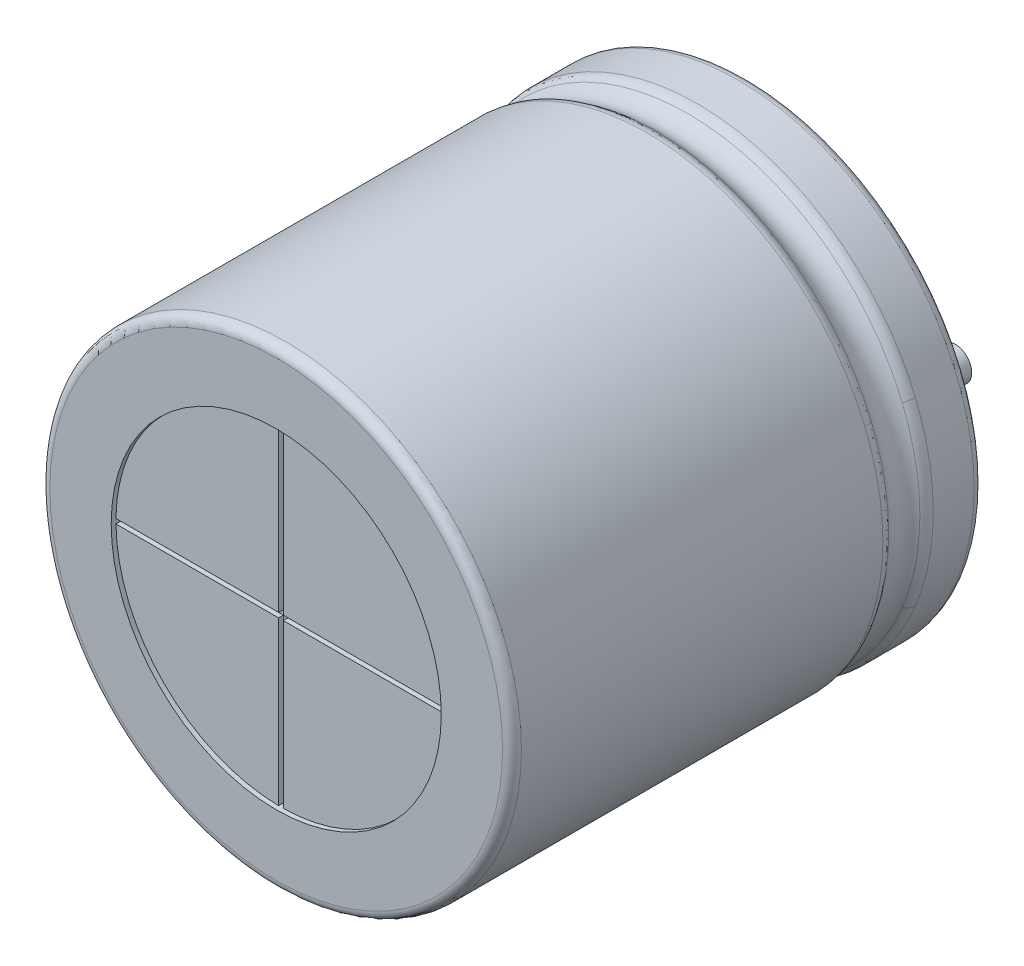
ISO-10303-21;
HEADER;
FILE_DESCRIPTION(('STEP AP214'),'2;1');
FILE_NAME('part.step','',(''),(''),'','','');
FILE_SCHEMA(('AUTOMOTIVE_DESIGN { 1 0 10303 214 1 1 1 1 }'));
ENDSEC;
DATA;
#1=APPLICATION_CONTEXT('core data for automotive mechanical design processes');
#2=APPLICATION_PROTOCOL_DEFINITION('international standard','automotive_design',2000,#1);
#3=PRODUCT_CONTEXT('',#1,'mechanical');
#4=PRODUCT('Part','Part','',(#3));
#5=PRODUCT_RELATED_PRODUCT_CATEGORY('part','',(#4));
#6=PRODUCT_DEFINITION_FORMATION('','',#4);
#7=PRODUCT_DEFINITION_CONTEXT('part definition',#1,'design');
#8=PRODUCT_DEFINITION('design','',#6,#7);
#9=PRODUCT_DEFINITION_SHAPE('','',#8);
#10=(LENGTH_UNIT() NAMED_UNIT(*) SI_UNIT(.MILLI.,.METRE.));
#11=(NAMED_UNIT(*) PLANE_ANGLE_UNIT() SI_UNIT($,.RADIAN.));
#12=(NAMED_UNIT(*) SI_UNIT($,.STERADIAN.) SOLID_ANGLE_UNIT());
#13=UNCERTAINTY_MEASURE_WITH_UNIT(LENGTH_MEASURE(1.E-05),#10,'distance_accuracy_value','');
#14=(GEOMETRIC_REPRESENTATION_CONTEXT(3) GLOBAL_UNCERTAINTY_ASSIGNED_CONTEXT((#13)) GLOBAL_UNIT_ASSIGNED_CONTEXT((#10,
#11,#12)) REPRESENTATION_CONTEXT('',''));
#15=CARTESIAN_POINT('',(0.,0.,0.));
#16=DIRECTION('',(0.,0.,1.));
#17=DIRECTION('',(1.,0.,0.));
#18=AXIS2_PLACEMENT_3D('',#15,#16,#17);
#19=CARTESIAN_POINT('',(5.,0.,-1.9));
#20=DIRECTION('',(0.,0.,1.));
#21=DIRECTION('',(1.,0.,0.));
#22=AXIS2_PLACEMENT_3D('',#19,#20,#21);
#23=PLANE('',#22);
#24=CARTESIAN_POINT('',(5.,0.,-1.9));
#25=DIRECTION('',(0.,0.,1.));
#26=DIRECTION('',(1.,0.,0.));
#27=AXIS2_PLACEMENT_3D('',#24,#25,#26);
#28=CIRCLE('',#27,0.35);
#29=CARTESIAN_POINT('',(5.35,0.,-1.9));
#30=VERTEX_POINT('',#29);
#31=EDGE_CURVE('E250',#30,#30,#28,.T.);
#32=ORIENTED_EDGE('',*,*,#31,.F.);
#33=EDGE_LOOP('',(#32));
#34=FACE_BOUND('',#33,.T.);
#35=ADVANCED_FACE('F18',(#34),#23,.F.);
#36=CARTESIAN_POINT('',(0.,0.,-2.));
#37=DIRECTION('',(0.,0.,1.));
#38=DIRECTION('',(1.,0.,0.));
#39=AXIS2_PLACEMENT_3D('',#36,#37,#38);
#40=PLANE('',#39);
#41=CARTESIAN_POINT('',(0.,0.,-2.));
#42=DIRECTION('',(0.,0.,1.));
#43=DIRECTION('',(1.,0.,0.));
#44=AXIS2_PLACEMENT_3D('',#41,#42,#43);
#45=CIRCLE('',#44,0.35);
#46=CARTESIAN_POINT('',(0.35,0.,-2.));
#47=VERTEX_POINT('',#46);
#48=EDGE_CURVE('E247',#47,#47,#45,.T.);
#49=ORIENTED_EDGE('',*,*,#48,.F.);
#50=EDGE_LOOP('',(#49));
#51=FACE_BOUND('',#50,.T.);
#52=ADVANCED_FACE('F490',(#51),#40,.F.);
#53=CARTESIAN_POINT('',(5.,0.,0.3));
#54=DIRECTION('',(0.,0.,1.));
#55=DIRECTION('',(1.,0.,0.));
#56=AXIS2_PLACEMENT_3D('',#53,#54,#55);
#57=CYLINDRICAL_SURFACE('',#56,0.35);
#58=ORIENTED_EDGE('',*,*,#31,.T.);
#59=EDGE_LOOP('',(#58));
#60=FACE_BOUND('',#59,.T.);
#61=CARTESIAN_POINT('',(5.,0.,0.2));
#62=DIRECTION('',(0.,0.,1.));
#63=DIRECTION('',(1.,0.,0.));
#64=AXIS2_PLACEMENT_3D('',#61,#62,#63);
#65=CIRCLE('',#64,0.35);
#66=CARTESIAN_POINT('',(5.35,0.,0.2));
#67=VERTEX_POINT('',#66);
#68=EDGE_CURVE('E244',#67,#67,#65,.F.);
#69=ORIENTED_EDGE('',*,*,#68,.T.);
#70=EDGE_LOOP('',(#69));
#71=FACE_BOUND('',#70,.T.);
#72=ADVANCED_FACE('F487',(#60,#71),#57,.T.);
#73=CARTESIAN_POINT('',(0.,0.,0.3));
#74=DIRECTION('',(0.,0.,1.));
#75=DIRECTION('',(1.,0.,0.));
#76=AXIS2_PLACEMENT_3D('',#73,#74,#75);
#77=CYLINDRICAL_SURFACE('',#76,0.35);
#78=ORIENTED_EDGE('',*,*,#48,.T.);
#79=EDGE_LOOP('',(#78));
#80=FACE_BOUND('',#79,.T.);
#81=CARTESIAN_POINT('',(0.,0.,0.2));
#82=DIRECTION('',(0.,0.,1.));
#83=DIRECTION('',(1.,0.,0.));
#84=AXIS2_PLACEMENT_3D('',#81,#82,#83);
#85=CIRCLE('',#84,0.35);
#86=CARTESIAN_POINT('',(0.35,0.,0.2));
#87=VERTEX_POINT('',#86);
#88=EDGE_CURVE('E241',#87,#87,#85,.F.);
#89=ORIENTED_EDGE('',*,*,#88,.T.);
#90=EDGE_LOOP('',(#89));
#91=FACE_BOUND('',#90,.T.);
#92=ADVANCED_FACE('F483',(#80,#91),#77,.T.);
#93=CARTESIAN_POINT('',(2.5,0.,0.2));
#94=DIRECTION('',(0.,0.,1.));
#95=DIRECTION('',(1.,0.,0.));
#96=AXIS2_PLACEMENT_3D('',#93,#94,#95);
#97=PLANE('',#96);
#98=ORIENTED_EDGE('',*,*,#88,.F.);
#99=EDGE_LOOP('',(#98));
#100=FACE_BOUND('',#99,.T.);
#101=ORIENTED_EDGE('',*,*,#68,.F.);
#102=EDGE_LOOP('',(#101));
#103=FACE_BOUND('',#102,.T.);
#104=CARTESIAN_POINT('',(2.5,0.,0.2));
#105=DIRECTION('',(0.,0.,-1.));
#106=DIRECTION('',(-1.,0.,0.));
#107=AXIS2_PLACEMENT_3D('',#104,#105,#106);
#108=CIRCLE('',#107,3.5);
#109=CARTESIAN_POINT('',(-1.,0.,0.2));
#110=VERTEX_POINT('',#109);
#111=EDGE_CURVE('E163',#110,#110,#108,.T.);
#112=ORIENTED_EDGE('',*,*,#111,.T.);
#113=EDGE_LOOP('',(#112));
#114=FACE_BOUND('',#113,.T.);
#115=ADVANCED_FACE('F479',(#100,#103,#114),#97,.F.);
#116=CARTESIAN_POINT('',(2.5,0.,0.3));
#117=DIRECTION('',(0.,0.,-1.));
#118=DIRECTION('',(-1.,0.,0.));
#119=AXIS2_PLACEMENT_3D('',#116,#117,#118);
#120=CYLINDRICAL_SURFACE('',#119,3.5);
#121=ORIENTED_EDGE('',*,*,#111,.F.);
#122=EDGE_LOOP('',(#121));
#123=FACE_BOUND('',#122,.T.);
#124=CARTESIAN_POINT('',(2.5,0.,0.));
#125=DIRECTION('',(0.,0.,-1.));
#126=DIRECTION('',(-1.,0.,0.));
#127=AXIS2_PLACEMENT_3D('',#124,#125,#126);
#128=CIRCLE('',#127,3.5);
#129=CARTESIAN_POINT('',(-1.,0.,0.));
#130=VERTEX_POINT('',#129);
#131=EDGE_CURVE('E228',#130,#130,#128,.F.);
#132=ORIENTED_EDGE('',*,*,#131,.F.);
#133=EDGE_LOOP('',(#132));
#134=FACE_BOUND('',#133,.T.);
#135=ADVANCED_FACE('F476',(#123,#134),#120,.F.);
#136=CARTESIAN_POINT('',(2.5,0.,9.8));
#137=DIRECTION('',(0.,0.,1.));
#138=DIRECTION('',(1.,0.,0.));
#139=AXIS2_PLACEMENT_3D('',#136,#137,#138);
#140=PLANE('',#139);
#141=DIRECTION('',(-1.,0.,0.));
#142=VECTOR('',#141,1.);
#143=CARTESIAN_POINT('',(2.45,0.05,9.8));
#144=LINE('',#143,#142);
#145=CARTESIAN_POINT('',(2.45,0.0499999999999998,9.8));
#146=VERTEX_POINT('',#145);
#147=CARTESIAN_POINT('',(-0.999642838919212,0.0500000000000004,9.8));
#148=VERTEX_POINT('',#147);
#149=EDGE_CURVE('E187',#146,#148,#144,.T.);
#150=ORIENTED_EDGE('',*,*,#149,.T.);
#151=CARTESIAN_POINT('',(2.5,0.,9.8));
#152=DIRECTION('',(0.,0.,1.));
#153=DIRECTION('',(1.,0.,0.));
#154=AXIS2_PLACEMENT_3D('',#151,#152,#153);
#155=CIRCLE('',#154,3.5);
#156=CARTESIAN_POINT('',(-0.999642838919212,-0.0500000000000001,9.8));
#157=VERTEX_POINT('',#156);
#158=EDGE_CURVE('E231',#148,#157,#155,.T.);
#159=ORIENTED_EDGE('',*,*,#158,.T.);
#160=DIRECTION('',(1.,0.,0.));
#161=VECTOR('',#160,1.);
#162=CARTESIAN_POINT('',(-7.55,-0.05,9.8));
#163=LINE('',#162,#161);
#164=CARTESIAN_POINT('',(2.45,-0.05,9.8));
#165=VERTEX_POINT('',#164);
#166=EDGE_CURVE('E182',#157,#165,#163,.T.);
#167=ORIENTED_EDGE('',*,*,#166,.T.);
#168=DIRECTION('',(0.,-1.,0.));
#169=VECTOR('',#168,1.);
#170=CARTESIAN_POINT('',(2.45,-0.05,9.8));
#171=LINE('',#170,#169);
#172=CARTESIAN_POINT('',(2.45,-3.49964283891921,9.8));
#173=VERTEX_POINT('',#172);
#174=EDGE_CURVE('E160',#165,#173,#171,.T.);
#175=ORIENTED_EDGE('',*,*,#174,.T.);
#176=CARTESIAN_POINT('',(2.5,0.,9.8));
#177=DIRECTION('',(0.,0.,1.));
#178=DIRECTION('',(1.,0.,0.));
#179=AXIS2_PLACEMENT_3D('',#176,#177,#178);
#180=CIRCLE('',#179,3.5);
#181=CARTESIAN_POINT('',(2.55,-3.49964283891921,9.8));
#182=VERTEX_POINT('',#181);
#183=EDGE_CURVE('E141',#173,#182,#180,.T.);
#184=ORIENTED_EDGE('',*,*,#183,.T.);
#185=DIRECTION('',(0.,1.,0.));
#186=VECTOR('',#185,1.);
#187=CARTESIAN_POINT('',(2.55,-10.05,9.8));
#188=LINE('',#187,#186);
#189=CARTESIAN_POINT('',(2.55,-0.0499999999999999,9.8));
#190=VERTEX_POINT('',#189);
#191=EDGE_CURVE('E151',#182,#190,#188,.T.);
#192=ORIENTED_EDGE('',*,*,#191,.T.);
#193=DIRECTION('',(1.,0.,0.));
#194=VECTOR('',#193,1.);
#195=CARTESIAN_POINT('',(2.55,-0.05,9.8));
#196=LINE('',#195,#194);
#197=CARTESIAN_POINT('',(5.99964283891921,-0.0500000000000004,9.8));
#198=VERTEX_POINT('',#197);
#199=EDGE_CURVE('E170',#190,#198,#196,.T.);
#200=ORIENTED_EDGE('',*,*,#199,.T.);
#201=CARTESIAN_POINT('',(2.5,0.,9.8));
#202=DIRECTION('',(0.,0.,1.));
#203=DIRECTION('',(1.,0.,0.));
#204=AXIS2_PLACEMENT_3D('',#201,#202,#203);
#205=CIRCLE('',#204,3.5);
#206=CARTESIAN_POINT('',(5.99964283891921,0.0500000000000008,9.8));
#207=VERTEX_POINT('',#206);
#208=EDGE_CURVE('E162',#198,#207,#205,.T.);
#209=ORIENTED_EDGE('',*,*,#208,.T.);
#210=DIRECTION('',(-1.,0.,0.));
#211=VECTOR('',#210,1.);
#212=CARTESIAN_POINT('',(12.55,0.05,9.8));
#213=LINE('',#212,#211);
#214=CARTESIAN_POINT('',(2.55,0.0500000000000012,9.8));
#215=VERTEX_POINT('',#214);
#216=EDGE_CURVE('E206',#207,#215,#213,.T.);
#217=ORIENTED_EDGE('',*,*,#216,.T.);
#218=DIRECTION('',(0.,1.,0.));
#219=VECTOR('',#218,1.);
#220=CARTESIAN_POINT('',(2.55,0.05,9.8));
#221=LINE('',#220,#219);
#222=CARTESIAN_POINT('',(2.55,3.49964283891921,9.8));
#223=VERTEX_POINT('',#222);
#224=EDGE_CURVE('E199',#215,#223,#221,.T.);
#225=ORIENTED_EDGE('',*,*,#224,.T.);
#226=CARTESIAN_POINT('',(2.5,0.,9.8));
#227=DIRECTION('',(0.,0.,1.));
#228=DIRECTION('',(1.,0.,0.));
#229=AXIS2_PLACEMENT_3D('',#226,#227,#228);
#230=CIRCLE('',#229,3.5);
#231=CARTESIAN_POINT('',(2.45,3.49964283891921,9.8));
#232=VERTEX_POINT('',#231);
#233=EDGE_CURVE('E234',#223,#232,#230,.T.);
#234=ORIENTED_EDGE('',*,*,#233,.T.);
#235=DIRECTION('',(0.,-1.,0.));
#236=VECTOR('',#235,1.);
#237=CARTESIAN_POINT('',(2.45,10.05,9.8));
#238=LINE('',#237,#236);
#239=EDGE_CURVE('E193',#232,#146,#238,.T.);
#240=ORIENTED_EDGE('',*,*,#239,.T.);
#241=EDGE_LOOP('',(#150,#159,#167,#175,#184,#192,#200,#209,#217,#225,#234,#240));
#242=FACE_BOUND('',#241,.T.);
#243=ADVANCED_FACE('F156',(#242),#140,.T.);
#244=CARTESIAN_POINT('',(2.5,0.,0.));
#245=DIRECTION('',(0.,0.,-1.));
#246=DIRECTION('',(-1.,0.,0.));
#247=AXIS2_PLACEMENT_3D('',#244,#245,#246);
#248=PLANE('',#247);
#249=CARTESIAN_POINT('',(2.5,0.,0.));
#250=DIRECTION('',(0.,0.,1.));
#251=DIRECTION('',(0.923879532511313,-0.382683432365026,0.));
#252=AXIS2_PLACEMENT_3D('',#249,#250,#251);
#253=CIRCLE('',#252,4.79999999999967);
#254=CARTESIAN_POINT('',(6.934621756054,1.836880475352,0.));
#255=VERTEX_POINT('',#254);
#256=CARTESIAN_POINT('',(6.934621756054,-1.836880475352,0.));
#257=VERTEX_POINT('',#256);
#258=EDGE_CURVE('E203',#255,#257,#253,.F.);
#259=ORIENTED_EDGE('',*,*,#258,.T.);
#260=CARTESIAN_POINT('',(2.5,0.,0.));
#261=DIRECTION('',(0.,0.,1.));
#262=DIRECTION('',(0.923879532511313,0.382683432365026,0.));
#263=AXIS2_PLACEMENT_3D('',#260,#261,#262);
#264=CIRCLE('',#263,4.79999999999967);
#265=EDGE_CURVE('E436',#257,#255,#264,.F.);
#266=ORIENTED_EDGE('',*,*,#265,.T.);
#267=EDGE_LOOP('',(#259,#266));
#268=FACE_BOUND('',#267,.T.);
#269=ORIENTED_EDGE('',*,*,#131,.T.);
#270=EDGE_LOOP('',(#269));
#271=FACE_BOUND('',#270,.T.);
#272=ADVANCED_FACE('F461',(#268,#271),#248,.T.);
#273=CARTESIAN_POINT('',(2.55,0.05,9.9));
#274=DIRECTION('',(1.,0.,0.));
#275=DIRECTION('',(0.,1.,0.));
#276=AXIS2_PLACEMENT_3D('',#273,#274,#275);
#277=PLANE('',#276);
#278=ORIENTED_EDGE('',*,*,#224,.F.);
#279=DIRECTION('',(0.,0.,1.));
#280=VECTOR('',#279,1.);
#281=CARTESIAN_POINT('',(2.55,0.0500000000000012,9.9));
#282=LINE('',#281,#280);
#283=CARTESIAN_POINT('',(2.55,0.0500000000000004,9.9));
#284=VERTEX_POINT('',#283);
#285=EDGE_CURVE('E190',#215,#284,#282,.T.);
#286=ORIENTED_EDGE('',*,*,#285,.T.);
#287=DIRECTION('',(0.,-1.,0.));
#288=VECTOR('',#287,1.);
#289=CARTESIAN_POINT('',(2.55,0.,9.9));
#290=LINE('',#289,#288);
#291=CARTESIAN_POINT('',(2.55,3.49964283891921,9.9));
#292=VERTEX_POINT('',#291);
#293=EDGE_CURVE('E861',#292,#284,#290,.T.);
#294=ORIENTED_EDGE('',*,*,#293,.F.);
#295=DIRECTION('',(0.,0.,1.));
#296=VECTOR('',#295,1.);
#297=CARTESIAN_POINT('',(2.55,3.499642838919,9.9));
#298=LINE('',#297,#296);
#299=EDGE_CURVE('E202',#223,#292,#298,.T.);
#300=ORIENTED_EDGE('',*,*,#299,.F.);
#301=EDGE_LOOP('',(#278,#286,#294,#300));
#302=FACE_BOUND('',#301,.T.);
#303=ADVANCED_FACE('F471',(#302),#277,.F.);
#304=CARTESIAN_POINT('',(12.55,0.05,9.9));
#305=DIRECTION('',(0.,1.,0.));
#306=DIRECTION('',(-1.,0.,0.));
#307=AXIS2_PLACEMENT_3D('',#304,#305,#306);
#308=PLANE('',#307);
#309=ORIENTED_EDGE('',*,*,#216,.F.);
#310=DIRECTION('',(0.,0.,1.));
#311=VECTOR('',#310,1.);
#312=CARTESIAN_POINT('',(5.999642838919,0.0500000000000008,9.9));
#313=LINE('',#312,#311);
#314=CARTESIAN_POINT('',(5.99964283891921,0.0500000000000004,9.9));
#315=VERTEX_POINT('',#314);
#316=EDGE_CURVE('E208',#315,#207,#313,.F.);
#317=ORIENTED_EDGE('',*,*,#316,.F.);
#318=DIRECTION('',(1.,0.,0.));
#319=VECTOR('',#318,1.);
#320=CARTESIAN_POINT('',(2.5,0.05,9.9));
#321=LINE('',#320,#319);
#322=EDGE_CURVE('E858',#284,#315,#321,.T.);
#323=ORIENTED_EDGE('',*,*,#322,.F.);
#324=ORIENTED_EDGE('',*,*,#285,.F.);
#325=EDGE_LOOP('',(#309,#317,#323,#324));
#326=FACE_BOUND('',#325,.T.);
#327=ADVANCED_FACE('F757',(#326),#308,.F.);
#328=CARTESIAN_POINT('',(2.45,0.05,9.9));
#329=DIRECTION('',(0.,1.,0.));
#330=DIRECTION('',(-1.,0.,0.));
#331=AXIS2_PLACEMENT_3D('',#328,#329,#330);
#332=PLANE('',#331);
#333=ORIENTED_EDGE('',*,*,#149,.F.);
#334=DIRECTION('',(0.,0.,1.));
#335=VECTOR('',#334,1.);
#336=CARTESIAN_POINT('',(2.45,0.0499999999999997,9.9));
#337=LINE('',#336,#335);
#338=CARTESIAN_POINT('',(2.45,0.0500000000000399,9.9));
#339=VERTEX_POINT('',#338);
#340=EDGE_CURVE('E195',#146,#339,#337,.T.);
#341=ORIENTED_EDGE('',*,*,#340,.T.);
#342=DIRECTION('',(1.,0.,0.));
#343=VECTOR('',#342,1.);
#344=CARTESIAN_POINT('',(2.5,0.05000000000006,9.9));
#345=LINE('',#344,#343);
#346=CARTESIAN_POINT('',(-0.999642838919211,0.0500000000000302,9.9));
#347=VERTEX_POINT('',#346);
#348=EDGE_CURVE('E860',#347,#339,#345,.T.);
#349=ORIENTED_EDGE('',*,*,#348,.F.);
#350=DIRECTION('',(0.,0.,1.));
#351=VECTOR('',#350,1.);
#352=CARTESIAN_POINT('',(-0.999642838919,0.0500000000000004,9.9));
#353=LINE('',#352,#351);
#354=EDGE_CURVE('E189',#148,#347,#353,.T.);
#355=ORIENTED_EDGE('',*,*,#354,.F.);
#356=EDGE_LOOP('',(#333,#341,#349,#355));
#357=FACE_BOUND('',#356,.T.);
#358=ADVANCED_FACE('F748',(#357),#332,.F.);
#359=CARTESIAN_POINT('',(2.45,10.05,9.9));
#360=DIRECTION('',(-1.,0.,0.));
#361=DIRECTION('',(0.,-1.,0.));
#362=AXIS2_PLACEMENT_3D('',#359,#360,#361);
#363=PLANE('',#362);
#364=ORIENTED_EDGE('',*,*,#239,.F.);
#365=DIRECTION('',(0.,0.,1.));
#366=VECTOR('',#365,1.);
#367=CARTESIAN_POINT('',(2.45,3.499642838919,9.9));
#368=LINE('',#367,#366);
#369=CARTESIAN_POINT('',(2.45,3.49964283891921,9.9));
#370=VERTEX_POINT('',#369);
#371=EDGE_CURVE('E196',#370,#232,#368,.F.);
#372=ORIENTED_EDGE('',*,*,#371,.F.);
#373=DIRECTION('',(0.,-1.,0.));
#374=VECTOR('',#373,1.);
#375=CARTESIAN_POINT('',(2.45,0.,9.9));
#376=LINE('',#375,#374);
#377=EDGE_CURVE('E896',#339,#370,#376,.F.);
#378=ORIENTED_EDGE('',*,*,#377,.F.);
#379=ORIENTED_EDGE('',*,*,#340,.F.);
#380=EDGE_LOOP('',(#364,#372,#378,#379));
#381=FACE_BOUND('',#380,.T.);
#382=ADVANCED_FACE('F739',(#381),#363,.F.);
#383=CARTESIAN_POINT('',(-7.55,-0.05,9.9));
#384=DIRECTION('',(0.,-1.,0.));
#385=DIRECTION('',(1.,0.,0.));
#386=AXIS2_PLACEMENT_3D('',#383,#384,#385);
#387=PLANE('',#386);
#388=ORIENTED_EDGE('',*,*,#166,.F.);
#389=DIRECTION('',(0.,0.,1.));
#390=VECTOR('',#389,1.);
#391=CARTESIAN_POINT('',(-0.999642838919,-0.0500000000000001,9.9));
#392=LINE('',#391,#390);
#393=CARTESIAN_POINT('',(-0.999642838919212,-0.05,9.9));
#394=VERTEX_POINT('',#393);
#395=EDGE_CURVE('E184',#394,#157,#392,.F.);
#396=ORIENTED_EDGE('',*,*,#395,.F.);
#397=DIRECTION('',(1.,0.,0.));
#398=VECTOR('',#397,1.);
#399=CARTESIAN_POINT('',(2.5,-0.05,9.9));
#400=LINE('',#399,#398);
#401=CARTESIAN_POINT('',(2.45,-0.05,9.9));
#402=VERTEX_POINT('',#401);
#403=EDGE_CURVE('E886',#402,#394,#400,.F.);
#404=ORIENTED_EDGE('',*,*,#403,.F.);
#405=DIRECTION('',(0.,0.,1.));
#406=VECTOR('',#405,1.);
#407=CARTESIAN_POINT('',(2.45,-0.05,9.9));
#408=LINE('',#407,#406);
#409=EDGE_CURVE('E179',#402,#165,#408,.F.);
#410=ORIENTED_EDGE('',*,*,#409,.T.);
#411=EDGE_LOOP('',(#388,#396,#404,#410));
#412=FACE_BOUND('',#411,.T.);
#413=ADVANCED_FACE('F730',(#412),#387,.F.);
#414=CARTESIAN_POINT('',(2.45,-0.05,9.9));
#415=DIRECTION('',(-1.,0.,0.));
#416=DIRECTION('',(0.,-1.,0.));
#417=AXIS2_PLACEMENT_3D('',#414,#415,#416);
#418=PLANE('',#417);
#419=ORIENTED_EDGE('',*,*,#174,.F.);
#420=ORIENTED_EDGE('',*,*,#409,.F.);
#421=DIRECTION('',(0.,-1.,0.));
#422=VECTOR('',#421,1.);
#423=CARTESIAN_POINT('',(2.45,0.,9.9));
#424=LINE('',#423,#422);
#425=CARTESIAN_POINT('',(2.45,-3.49964283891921,9.9));
#426=VERTEX_POINT('',#425);
#427=EDGE_CURVE('E883',#426,#402,#424,.F.);
#428=ORIENTED_EDGE('',*,*,#427,.F.);
#429=DIRECTION('',(0.,0.,1.));
#430=VECTOR('',#429,1.);
#431=CARTESIAN_POINT('',(2.45,-3.499642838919,9.9));
#432=LINE('',#431,#430);
#433=EDGE_CURVE('E152',#173,#426,#432,.T.);
#434=ORIENTED_EDGE('',*,*,#433,.F.);
#435=EDGE_LOOP('',(#419,#420,#428,#434));
#436=FACE_BOUND('',#435,.T.);
#437=ADVANCED_FACE('F723',(#436),#418,.F.);
#438=CARTESIAN_POINT('',(2.55,-10.05,9.9));
#439=DIRECTION('',(1.,0.,0.));
#440=DIRECTION('',(0.,1.,0.));
#441=AXIS2_PLACEMENT_3D('',#438,#439,#440);
#442=PLANE('',#441);
#443=ORIENTED_EDGE('',*,*,#191,.F.);
#444=DIRECTION('',(0.,0.,1.));
#445=VECTOR('',#444,1.);
#446=CARTESIAN_POINT('',(2.55,-3.499642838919,9.9));
#447=LINE('',#446,#445);
#448=CARTESIAN_POINT('',(2.55,-3.49964283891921,9.9));
#449=VERTEX_POINT('',#448);
#450=EDGE_CURVE('E144',#449,#182,#447,.F.);
#451=ORIENTED_EDGE('',*,*,#450,.F.);
#452=DIRECTION('',(0.,-1.,0.));
#453=VECTOR('',#452,1.);
#454=CARTESIAN_POINT('',(2.55,0.,9.9));
#455=LINE('',#454,#453);
#456=CARTESIAN_POINT('',(2.55,-0.05000000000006,9.9));
#457=VERTEX_POINT('',#456);
#458=EDGE_CURVE('E881',#457,#449,#455,.T.);
#459=ORIENTED_EDGE('',*,*,#458,.F.);
#460=DIRECTION('',(0.,0.,1.));
#461=VECTOR('',#460,1.);
#462=CARTESIAN_POINT('',(2.55,-0.05,9.9));
#463=LINE('',#462,#461);
#464=EDGE_CURVE('E167',#457,#190,#463,.F.);
#465=ORIENTED_EDGE('',*,*,#464,.T.);
#466=EDGE_LOOP('',(#443,#451,#459,#465));
#467=FACE_BOUND('',#466,.T.);
#468=ADVANCED_FACE('F165',(#467),#442,.F.);
#469=CARTESIAN_POINT('',(2.55,-0.05,9.9));
#470=DIRECTION('',(0.,-1.,0.));
#471=DIRECTION('',(1.,0.,0.));
#472=AXIS2_PLACEMENT_3D('',#469,#470,#471);
#473=PLANE('',#472);
#474=ORIENTED_EDGE('',*,*,#199,.F.);
#475=ORIENTED_EDGE('',*,*,#464,.F.);
#476=DIRECTION('',(1.,0.,0.));
#477=VECTOR('',#476,1.);
#478=CARTESIAN_POINT('',(2.5,-0.05000000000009,9.9));
#479=LINE('',#478,#477);
#480=CARTESIAN_POINT('',(5.99964283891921,-0.0500000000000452,9.9));
#481=VERTEX_POINT('',#480);
#482=EDGE_CURVE('E375',#481,#457,#479,.F.);
#483=ORIENTED_EDGE('',*,*,#482,.F.);
#484=DIRECTION('',(0.,0.,1.));
#485=VECTOR('',#484,1.);
#486=CARTESIAN_POINT('',(5.999642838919,-0.0500000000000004,9.9));
#487=LINE('',#486,#485);
#488=EDGE_CURVE('E435',#198,#481,#487,.T.);
#489=ORIENTED_EDGE('',*,*,#488,.F.);
#490=EDGE_LOOP('',(#474,#475,#483,#489));
#491=FACE_BOUND('',#490,.T.);
#492=ADVANCED_FACE('F424',(#491),#473,.F.);
#493=CARTESIAN_POINT('',(2.5,0.,0.2));
#494=DIRECTION('',(0.,0.,1.));
#495=DIRECTION('',(0.923879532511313,-0.382683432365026,0.));
#496=AXIS2_PLACEMENT_3D('',#493,#494,#495);
#497=TOROIDAL_SURFACE('',#496,4.79999999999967,0.2);
#498=CARTESIAN_POINT('',(2.5,0.,0.2));
#499=DIRECTION('',(0.,0.,1.));
#500=DIRECTION('',(1.,0.,0.));
#501=AXIS2_PLACEMENT_3D('',#498,#499,#500);
#502=CIRCLE('',#501,5.);
#503=CARTESIAN_POINT('',(7.5,0.,0.2));
#504=VERTEX_POINT('',#503);
#505=EDGE_CURVE('E433',#504,#504,#502,.T.);
#506=ORIENTED_EDGE('',*,*,#505,.F.);
#507=EDGE_LOOP('',(#506));
#508=FACE_BOUND('',#507,.T.);
#509=ORIENTED_EDGE('',*,*,#258,.F.);
#510=ORIENTED_EDGE('',*,*,#265,.F.);
#511=EDGE_LOOP('',(#509,#510));
#512=FACE_BOUND('',#511,.T.);
#513=ADVANCED_FACE('F412',(#508,#512),#497,.T.);
#514=CARTESIAN_POINT('',(2.5,0.,9.9));
#515=DIRECTION('',(0.,0.,1.));
#516=DIRECTION('',(0.,-1.,0.));
#517=AXIS2_PLACEMENT_3D('',#514,#515,#516);
#518=PLANE('',#517);
#519=ORIENTED_EDGE('',*,*,#293,.T.);
#520=ORIENTED_EDGE('',*,*,#322,.T.);
#521=CARTESIAN_POINT('',(2.5,0.,9.9));
#522=DIRECTION('',(0.,0.,-1.));
#523=DIRECTION('',(-1.,0.,0.));
#524=AXIS2_PLACEMENT_3D('',#521,#522,#523);
#525=CIRCLE('',#524,3.5);
#526=EDGE_CURVE('E224',#315,#292,#525,.F.);
#527=ORIENTED_EDGE('',*,*,#526,.T.);
#528=EDGE_LOOP('',(#519,#520,#527));
#529=FACE_BOUND('',#528,.T.);
#530=ADVANCED_FACE('F423',(#529),#518,.T.);
#531=CARTESIAN_POINT('',(2.5,0.,9.9));
#532=DIRECTION('',(0.,0.,1.));
#533=DIRECTION('',(0.,-1.,0.));
#534=AXIS2_PLACEMENT_3D('',#531,#532,#533);
#535=PLANE('',#534);
#536=ORIENTED_EDGE('',*,*,#348,.T.);
#537=ORIENTED_EDGE('',*,*,#377,.T.);
#538=CARTESIAN_POINT('',(2.5,0.,9.9));
#539=DIRECTION('',(0.,0.,-1.));
#540=DIRECTION('',(-1.,0.,0.));
#541=AXIS2_PLACEMENT_3D('',#538,#539,#540);
#542=CIRCLE('',#541,3.5);
#543=EDGE_CURVE('E221',#370,#347,#542,.F.);
#544=ORIENTED_EDGE('',*,*,#543,.T.);
#545=EDGE_LOOP('',(#536,#537,#544));
#546=FACE_BOUND('',#545,.T.);
#547=ADVANCED_FACE('F688',(#546),#535,.T.);
#548=CARTESIAN_POINT('',(2.5,0.,9.9));
#549=DIRECTION('',(0.,0.,1.));
#550=DIRECTION('',(0.,-1.,0.));
#551=AXIS2_PLACEMENT_3D('',#548,#549,#550);
#552=PLANE('',#551);
#553=CARTESIAN_POINT('',(2.5,0.,9.9));
#554=DIRECTION('',(0.,0.,-1.));
#555=DIRECTION('',(-1.,0.,0.));
#556=AXIS2_PLACEMENT_3D('',#553,#554,#555);
#557=CIRCLE('',#556,3.5);
#558=EDGE_CURVE('E218',#394,#426,#557,.F.);
#559=ORIENTED_EDGE('',*,*,#558,.T.);
#560=ORIENTED_EDGE('',*,*,#427,.T.);
#561=ORIENTED_EDGE('',*,*,#403,.T.);
#562=EDGE_LOOP('',(#559,#560,#561));
#563=FACE_BOUND('',#562,.T.);
#564=ADVANCED_FACE('F680',(#563),#552,.T.);
#565=CARTESIAN_POINT('',(2.5,0.,9.9));
#566=DIRECTION('',(0.,0.,1.));
#567=DIRECTION('',(0.,-1.,0.));
#568=AXIS2_PLACEMENT_3D('',#565,#566,#567);
#569=PLANE('',#568);
#570=CARTESIAN_POINT('',(2.5,0.,9.9));
#571=DIRECTION('',(0.,0.,-1.));
#572=DIRECTION('',(-1.,0.,0.));
#573=AXIS2_PLACEMENT_3D('',#570,#571,#572);
#574=CIRCLE('',#573,3.5);
#575=EDGE_CURVE('E147',#449,#481,#574,.F.);
#576=ORIENTED_EDGE('',*,*,#575,.T.);
#577=ORIENTED_EDGE('',*,*,#482,.T.);
#578=ORIENTED_EDGE('',*,*,#458,.T.);
#579=EDGE_LOOP('',(#576,#577,#578));
#580=FACE_BOUND('',#579,.T.);
#581=ADVANCED_FACE('F387',(#580),#569,.T.);
#582=CARTESIAN_POINT('',(2.5,0.,0.2));
#583=DIRECTION('',(0.,0.,1.));
#584=DIRECTION('',(1.,0.,0.));
#585=AXIS2_PLACEMENT_3D('',#582,#583,#584);
#586=CYLINDRICAL_SURFACE('',#585,5.);
#587=ORIENTED_EDGE('',*,*,#505,.T.);
#588=EDGE_LOOP('',(#587));
#589=FACE_BOUND('',#588,.T.);
#590=CARTESIAN_POINT('',(7.567608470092,0.831340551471,1.064979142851));
#591=CARTESIAN_POINT('',(7.529998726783,0.922138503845,1.064979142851));
#592=CARTESIAN_POINT('',(7.492436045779,1.012822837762,1.064979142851));
#593=CARTESIAN_POINT('',(7.454920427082,1.103393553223,1.064979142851));
#594=CARTESIAN_POINT('',(7.41745187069,1.193850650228,1.064979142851));
#595=CARTESIAN_POINT('',(7.380030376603,1.284194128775,1.064979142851));
#596=CARTESIAN_POINT('',(7.342655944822,1.374423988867,1.064979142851));
#597=CARTESIAN_POINT('',(7.305328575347,1.464540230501,1.064979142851));
#598=CARTESIAN_POINT('',(7.268048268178,1.554542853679,1.064979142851));
#599=CARTESIAN_POINT('',(7.230815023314,1.644431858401,1.064979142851));
#600=CARTESIAN_POINT('',(7.193628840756,1.734207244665,1.064979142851));
#601=CARTESIAN_POINT('',(7.156489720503,1.823869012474,1.064979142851));
#602=CARTESIAN_POINT('',(6.248842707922,4.015122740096,1.064979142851));
#603=CARTESIAN_POINT('',(4.321386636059,5.716779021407,1.064979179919));
#604=CARTESIAN_POINT('',(1.539129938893,6.39092051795,1.064978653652));
#605=CARTESIAN_POINT('',(-1.444295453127,5.513989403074,1.064980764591));
#606=CARTESIAN_POINT('',(-3.665575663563,3.32547112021,1.064976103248));
#607=CARTESIAN_POINT('',(-4.778923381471,8.212985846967E-12,1.064982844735));
#608=CARTESIAN_POINT('',(-3.665575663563,-3.325471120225,1.064976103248));
#609=CARTESIAN_POINT('',(-1.444295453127,-5.513989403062,1.06498076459));
#610=CARTESIAN_POINT('',(1.539129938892,-6.390920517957,1.064978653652));
#611=CARTESIAN_POINT('',(4.32138663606,-5.716779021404,1.064979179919));
#612=CARTESIAN_POINT('',(6.248842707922,-4.015122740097,1.064979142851));
#613=CARTESIAN_POINT('',(7.156489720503,-1.823869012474,1.064979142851));
#614=CARTESIAN_POINT('',(7.193628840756,-1.734207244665,1.064979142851));
#615=CARTESIAN_POINT('',(7.230815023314,-1.644431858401,1.064979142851));
#616=CARTESIAN_POINT('',(7.268048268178,-1.554542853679,1.064979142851));
#617=CARTESIAN_POINT('',(7.305328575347,-1.464540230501,1.064979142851));
#618=CARTESIAN_POINT('',(7.342655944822,-1.374423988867,1.064979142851));
#619=CARTESIAN_POINT('',(7.380030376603,-1.284194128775,1.064979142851));
#620=CARTESIAN_POINT('',(7.41745187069,-1.193850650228,1.064979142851));
#621=CARTESIAN_POINT('',(7.454920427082,-1.103393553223,1.064979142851));
#622=CARTESIAN_POINT('',(7.492436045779,-1.012822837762,1.064979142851));
#623=CARTESIAN_POINT('',(7.529998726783,-0.922138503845,1.064979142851));
#624=CARTESIAN_POINT('',(7.567608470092,-0.831340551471,1.064979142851));
#625=(BOUNDED_CURVE() B_SPLINE_CURVE(12,(#590,#591,#592,#593,#594,#595,#596,#597,#598,#599,#600,
#601,#602,#603,#604,#605,#606,#607,#608,#609,#610,#611,#612,#613,#614,#615,#616,#617,#618,#619,
#620,#621,#622,#623,#624),.UNSPECIFIED.,.F.,.F.) B_SPLINE_CURVE_WITH_KNOTS((13,11,11,13),
(-1.171231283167,-1.00186525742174E-12,27.48893571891,28.660167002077),
.UNSPECIFIED.) CURVE() GEOMETRIC_REPRESENTATION_ITEM() RATIONAL_B_SPLINE_CURVE((1.,1.,1.,1.,1.,
1.,1.,1.,1.,1.,1.,1.,1.,1.,1.,1.,1.,1.,1.,1.,1.,1.,1.,1.,1.,1.,1.,1.,1.,1.,1.,1.,1.,1.,1.)) REPRESENTATION_ITEM(''));
#626=CARTESIAN_POINT('',(7.11939766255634,1.9134171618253,1.06497909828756));
#627=VERTEX_POINT('',#626);
#628=CARTESIAN_POINT('',(7.11939766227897,-1.91341716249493,1.0649790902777));
#629=VERTEX_POINT('',#628);
#630=EDGE_CURVE('E370',#627,#629,#625,.T.);
#631=ORIENTED_EDGE('',*,*,#630,.F.);
#632=CARTESIAN_POINT('',(7.02800265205,-2.134064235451,1.064979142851));
#633=CARTESIAN_POINT('',(7.046281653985,-2.089934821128,1.064979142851));
#634=CARTESIAN_POINT('',(7.06456065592,-2.045805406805,1.064979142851));
#635=CARTESIAN_POINT('',(7.082839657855,-2.001675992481,1.064979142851));
#636=CARTESIAN_POINT('',(7.101118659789,-1.957546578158,1.064979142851));
#637=CARTESIAN_POINT('',(7.41995703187,-1.187802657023,1.064979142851));
#638=CARTESIAN_POINT('',(7.578078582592,-0.403179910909,1.064979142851));
#639=CARTESIAN_POINT('',(7.578077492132,0.403182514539,1.064979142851));
#640=CARTESIAN_POINT('',(7.41995647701,1.187803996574,1.064979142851));
#641=CARTESIAN_POINT('',(7.101118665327,1.957546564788,1.064979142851));
#642=CARTESIAN_POINT('',(7.082839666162,2.001675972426,1.064979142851));
#643=CARTESIAN_POINT('',(7.064560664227,2.04580538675,1.064979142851));
#644=CARTESIAN_POINT('',(7.046281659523,2.089934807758,1.064979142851));
#645=CARTESIAN_POINT('',(7.02800265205,2.134064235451,1.064979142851));
#646=(BOUNDED_CURVE() B_SPLINE_CURVE(5,(#632,#633,#634,#635,#636,#637,#638,#639,#640,#641,#642,
#643,#644,#645),.UNSPECIFIED.,.F.,.F.) B_SPLINE_CURVE_WITH_KNOTS((6,4,4,6),(-0.238826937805,
-6.36965999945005E-07,3.92699071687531,4.165817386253),
.UNSPECIFIED.) CURVE() GEOMETRIC_REPRESENTATION_ITEM() RATIONAL_B_SPLINE_CURVE((0.999999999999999,
0.999999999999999,0.999999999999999,0.999999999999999,0.999999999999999,0.999999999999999,
0.999999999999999,0.999999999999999,0.999999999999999,0.999999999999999,0.999999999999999,
0.999999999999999,0.999999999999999,0.999999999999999)) REPRESENTATION_ITEM(''));
#647=EDGE_CURVE('E227',#629,#627,#646,.T.);
#648=ORIENTED_EDGE('',*,*,#647,.F.);
#649=EDGE_LOOP('',(#631,#648));
#650=FACE_BOUND('',#649,.T.);
#651=ADVANCED_FACE('F377',(#589,#650),#586,.T.);
#652=CARTESIAN_POINT('',(7.02800265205,2.134064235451,1.064979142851));
#653=CARTESIAN_POINT('',(7.046281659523,2.089934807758,1.064979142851));
#654=CARTESIAN_POINT('',(7.064560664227,2.04580538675,1.064979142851));
#655=CARTESIAN_POINT('',(7.082839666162,2.001675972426,1.064979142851));
#656=CARTESIAN_POINT('',(7.101118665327,1.957546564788,1.064979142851));
#657=CARTESIAN_POINT('',(7.41995647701,1.187803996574,1.064979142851));
#658=CARTESIAN_POINT('',(7.578077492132,0.403182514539,1.064979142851));
#659=CARTESIAN_POINT('',(7.578078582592,-0.403179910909,1.064979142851));
#660=CARTESIAN_POINT('',(7.41995703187,-1.187802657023,1.064979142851));
#661=CARTESIAN_POINT('',(7.101118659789,-1.957546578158,1.064979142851));
#662=CARTESIAN_POINT('',(7.082839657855,-2.001675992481,1.064979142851));
#663=CARTESIAN_POINT('',(7.06456065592,-2.045805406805,1.064979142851));
#664=CARTESIAN_POINT('',(7.046281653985,-2.089934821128,1.064979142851));
#665=CARTESIAN_POINT('',(7.02800265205,-2.134064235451,1.064979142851));
#666=CARTESIAN_POINT('',(7.02800265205,2.134064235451,1.182962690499));
#667=CARTESIAN_POINT('',(7.046281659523,2.089934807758,1.182962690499));
#668=CARTESIAN_POINT('',(7.064560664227,2.04580538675,1.182962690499));
#669=CARTESIAN_POINT('',(7.082839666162,2.001675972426,1.182962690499));
#670=CARTESIAN_POINT('',(7.101118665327,1.957546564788,1.182962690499));
#671=CARTESIAN_POINT('',(7.41995647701,1.187803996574,1.182962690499));
#672=CARTESIAN_POINT('',(7.578077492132,0.403182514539,1.182962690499));
#673=CARTESIAN_POINT('',(7.578078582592,-0.403179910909,1.182962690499));
#674=CARTESIAN_POINT('',(7.41995703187,-1.187802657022,1.182962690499));
#675=CARTESIAN_POINT('',(7.101118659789,-1.957546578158,1.182962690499));
#676=CARTESIAN_POINT('',(7.082839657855,-2.001675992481,1.182962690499));
#677=CARTESIAN_POINT('',(7.06456065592,-2.045805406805,1.182962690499));
#678=CARTESIAN_POINT('',(7.046281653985,-2.089934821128,1.182962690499));
#679=CARTESIAN_POINT('',(7.02800265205,-2.134064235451,1.182962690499));
#680=CARTESIAN_POINT('',(6.953750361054,2.103307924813,1.269338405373));
#681=CARTESIAN_POINT('',(6.972323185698,2.05846915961,1.269338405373));
#682=CARTESIAN_POINT('',(6.990749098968,2.01398506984,1.269338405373));
#683=CARTESIAN_POINT('',(7.009028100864,1.9698556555,1.269338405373));
#684=CARTESIAN_POINT('',(7.027160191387,1.926080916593,1.269338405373));
#685=CARTESIAN_POINT('',(7.340872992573,1.168711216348,1.269338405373));
#686=CARTESIAN_POINT('',(7.496452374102,0.396701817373,1.269338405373));
#687=CARTESIAN_POINT('',(7.496453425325,-0.39669932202,1.269338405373));
#688=CARTESIAN_POINT('',(7.340873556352,-1.168709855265,1.269338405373));
#689=CARTESIAN_POINT('',(7.027160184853,-1.926080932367,1.269338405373));
#690=CARTESIAN_POINT('',(7.009028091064,-1.969855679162,1.269338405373));
#691=CARTESIAN_POINT('',(6.990749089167,-2.013985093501,1.269338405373));
#692=CARTESIAN_POINT('',(6.972323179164,-2.058469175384,1.269338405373));
#693=CARTESIAN_POINT('',(6.953750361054,-2.103307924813,1.269338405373));
#694=(BOUNDED_SURFACE() B_SPLINE_SURFACE(2,5,((#652,#653,#654,#655,#656,#657,#658,#659,#660,
#661,#662,#663,#664,#665),(#666,#667,#668,#669,#670,#671,#672,#673,#674,#675,#676,#677,#678,
#679),(#680,#681,#682,#683,#684,#685,#686,#687,#688,#689,#690,#691,#692,#693)),.UNSPECIFIED.,
.F.,.F.,.F.) B_SPLINE_SURFACE_WITH_KNOTS((3,3),(6,4,4,6),(0.,3.926991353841),(-0.238826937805,
-2.684273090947E-07,3.926991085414,4.165817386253),
.UNSPECIFIED.) GEOMETRIC_REPRESENTATION_ITEM() RATIONAL_B_SPLINE_SURFACE(((1.,1.,1.,1.,1.,1.,1.,
1.,1.,1.,1.,1.,1.,1.),(0.93061798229,0.93061798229,0.93061798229,0.93061798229,0.93061798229,
0.93061798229,0.93061798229,0.93061798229,0.93061798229,0.93061798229,0.93061798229,
0.93061798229,0.93061798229,0.93061798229),(1.,1.,1.,1.,1.,1.,1.,1.,1.,1.,1.,1.,1.,1.))) REPRESENTATION_ITEM('') SURFACE());
#695=CARTESIAN_POINT('',(6.84223380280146,-1.79861213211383,1.06497914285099));
#696=DIRECTION('',(-0.382683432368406,-0.923879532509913,0.));
#697=DIRECTION('',(0.923879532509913,-0.382683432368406,0.));
#698=AXIS2_PLACEMENT_3D('',#695,#696,#697);
#699=CIRCLE('',#698,0.300000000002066);
#700=CARTESIAN_POINT('',(7.04514536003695,-1.88266085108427,1.26933841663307));
#701=VERTEX_POINT('',#700);
#702=EDGE_CURVE('E217',#629,#701,#699,.T.);
#703=CARTESIAN_POINT('',(6.84223380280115,1.79861213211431,1.06497914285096));
#704=DIRECTION('',(-0.382683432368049,0.923879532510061,0.));
#705=DIRECTION('',(0.923879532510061,0.382683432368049,1.4456028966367E-13));
#706=AXIS2_PLACEMENT_3D('',#703,#704,#705);
#707=CIRCLE('',#706,0.30000000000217);
#708=CARTESIAN_POINT('',(7.04514536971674,1.88266085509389,1.26933840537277));
#709=VERTEX_POINT('',#708);
#710=EDGE_CURVE('E877',#709,#627,#707,.T.);
#711=CARTESIAN_POINT('',(2.5,0.,1.26933840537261));
#712=DIRECTION('',(0.,0.,1.));
#713=DIRECTION('',(0.923879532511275,0.382683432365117,0.));
#714=AXIS2_PLACEMENT_3D('',#711,#712,#713);
#715=CIRCLE('',#714,4.91962989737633);
#716=EDGE_CURVE('E215',#709,#701,#715,.F.);
#717=ORIENTED_EDGE('',*,*,#702,.F.);
#718=ORIENTED_EDGE('',*,*,#647,.T.);
#719=ORIENTED_EDGE('',*,*,#710,.F.);
#720=ORIENTED_EDGE('',*,*,#716,.T.);
#721=EDGE_LOOP('',(#717,#718,#719,#720));
#722=FACE_BOUND('',#721,.T.);
#723=ADVANCED_FACE('F386',(#722),#694,.T.);
#724=CARTESIAN_POINT('',(2.5,0.,10.));
#725=DIRECTION('',(0.,0.,-1.));
#726=DIRECTION('',(-1.,0.,0.));
#727=AXIS2_PLACEMENT_3D('',#724,#725,#726);
#728=CYLINDRICAL_SURFACE('',#727,3.5);
#729=CARTESIAN_POINT('',(2.5,0.,10.));
#730=DIRECTION('',(0.,0.,-1.));
#731=DIRECTION('',(-1.,0.,0.));
#732=AXIS2_PLACEMENT_3D('',#729,#730,#731);
#733=CIRCLE('',#732,3.5);
#734=CARTESIAN_POINT('',(-1.,0.,10.));
#735=VERTEX_POINT('',#734);
#736=EDGE_CURVE('E211',#735,#735,#733,.F.);
#737=ORIENTED_EDGE('',*,*,#736,.T.);
#738=EDGE_LOOP('',(#737));
#739=FACE_BOUND('',#738,.T.);
#740=ORIENTED_EDGE('',*,*,#450,.T.);
#741=ORIENTED_EDGE('',*,*,#183,.F.);
#742=ORIENTED_EDGE('',*,*,#433,.T.);
#743=ORIENTED_EDGE('',*,*,#558,.F.);
#744=ORIENTED_EDGE('',*,*,#395,.T.);
#745=ORIENTED_EDGE('',*,*,#158,.F.);
#746=ORIENTED_EDGE('',*,*,#354,.T.);
#747=ORIENTED_EDGE('',*,*,#543,.F.);
#748=ORIENTED_EDGE('',*,*,#371,.T.);
#749=ORIENTED_EDGE('',*,*,#233,.F.);
#750=ORIENTED_EDGE('',*,*,#299,.T.);
#751=ORIENTED_EDGE('',*,*,#526,.F.);
#752=ORIENTED_EDGE('',*,*,#316,.T.);
#753=ORIENTED_EDGE('',*,*,#208,.F.);
#754=ORIENTED_EDGE('',*,*,#488,.T.);
#755=ORIENTED_EDGE('',*,*,#575,.F.);
#756=EDGE_LOOP('',(#740,#741,#742,#743,#744,#745,#746,#747,#748,#749,#750,#751,#752,#753,#754,#755));
#757=FACE_BOUND('',#756,.T.);
#758=ADVANCED_FACE('F145',(#739,#757),#728,.F.);
#759=CARTESIAN_POINT('',(7.567608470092,-0.831340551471,1.064979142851));
#760=CARTESIAN_POINT('',(7.529998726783,-0.922138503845,1.064979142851));
#761=CARTESIAN_POINT('',(7.492436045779,-1.012822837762,1.064979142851));
#762=CARTESIAN_POINT('',(7.454920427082,-1.103393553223,1.064979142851));
#763=CARTESIAN_POINT('',(7.41745187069,-1.193850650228,1.064979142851));
#764=CARTESIAN_POINT('',(7.380030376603,-1.284194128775,1.064979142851));
#765=CARTESIAN_POINT('',(7.342655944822,-1.374423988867,1.064979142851));
#766=CARTESIAN_POINT('',(7.305328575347,-1.464540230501,1.064979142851));
#767=CARTESIAN_POINT('',(7.268048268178,-1.554542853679,1.064979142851));
#768=CARTESIAN_POINT('',(7.230815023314,-1.644431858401,1.064979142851));
#769=CARTESIAN_POINT('',(7.193628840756,-1.734207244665,1.064979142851));
#770=CARTESIAN_POINT('',(7.156489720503,-1.823869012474,1.064979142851));
#771=CARTESIAN_POINT('',(6.248842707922,-4.015122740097,1.064979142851));
#772=CARTESIAN_POINT('',(4.32138663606,-5.716779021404,1.064979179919));
#773=CARTESIAN_POINT('',(1.539129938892,-6.390920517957,1.064978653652));
#774=CARTESIAN_POINT('',(-1.444295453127,-5.513989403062,1.06498076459));
#775=CARTESIAN_POINT('',(-3.665575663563,-3.325471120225,1.064976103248));
#776=CARTESIAN_POINT('',(-4.778923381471,8.212985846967E-12,1.064982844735));
#777=CARTESIAN_POINT('',(-3.665575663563,3.32547112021,1.064976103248));
#778=CARTESIAN_POINT('',(-1.444295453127,5.513989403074,1.064980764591));
#779=CARTESIAN_POINT('',(1.539129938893,6.39092051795,1.064978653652));
#780=CARTESIAN_POINT('',(4.321386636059,5.716779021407,1.064979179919));
#781=CARTESIAN_POINT('',(6.248842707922,4.015122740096,1.064979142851));
#782=CARTESIAN_POINT('',(7.156489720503,1.823869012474,1.064979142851));
#783=CARTESIAN_POINT('',(7.193628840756,1.734207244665,1.064979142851));
#784=CARTESIAN_POINT('',(7.230815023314,1.644431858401,1.064979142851));
#785=CARTESIAN_POINT('',(7.268048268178,1.554542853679,1.064979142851));
#786=CARTESIAN_POINT('',(7.305328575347,1.464540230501,1.064979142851));
#787=CARTESIAN_POINT('',(7.342655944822,1.374423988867,1.064979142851));
#788=CARTESIAN_POINT('',(7.380030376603,1.284194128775,1.064979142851));
#789=CARTESIAN_POINT('',(7.41745187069,1.193850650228,1.064979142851));
#790=CARTESIAN_POINT('',(7.454920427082,1.103393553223,1.064979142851));
#791=CARTESIAN_POINT('',(7.492436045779,1.012822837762,1.064979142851));
#792=CARTESIAN_POINT('',(7.529998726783,0.922138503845,1.064979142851));
#793=CARTESIAN_POINT('',(7.567608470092,0.831340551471,1.064979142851));
#794=CARTESIAN_POINT('',(7.567608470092,-0.831340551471,1.182962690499));
#795=CARTESIAN_POINT('',(7.529998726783,-0.922138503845,1.182962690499));
#796=CARTESIAN_POINT('',(7.492436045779,-1.012822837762,1.182962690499));
#797=CARTESIAN_POINT('',(7.454920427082,-1.103393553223,1.182962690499));
#798=CARTESIAN_POINT('',(7.41745187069,-1.193850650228,1.182962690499));
#799=CARTESIAN_POINT('',(7.380030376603,-1.284194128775,1.182962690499));
#800=CARTESIAN_POINT('',(7.342655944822,-1.374423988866,1.182962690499));
#801=CARTESIAN_POINT('',(7.305328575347,-1.464540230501,1.182962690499));
#802=CARTESIAN_POINT('',(7.268048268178,-1.554542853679,1.182962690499));
#803=CARTESIAN_POINT('',(7.230815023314,-1.644431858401,1.182962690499));
#804=CARTESIAN_POINT('',(7.193628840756,-1.734207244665,1.182962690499));
#805=CARTESIAN_POINT('',(7.156489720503,-1.823869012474,1.182962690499));
#806=CARTESIAN_POINT('',(6.248842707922,-4.015122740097,1.182962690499));
#807=CARTESIAN_POINT('',(4.321386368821,-5.71677872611,1.182962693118));
#808=CARTESIAN_POINT('',(1.539129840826,-6.390923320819,1.182962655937));
#809=CARTESIAN_POINT('',(-1.44428930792,-5.513981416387,1.182962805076));
#810=CARTESIAN_POINT('',(-3.665594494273,-3.32548028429,1.182962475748));
#811=CARTESIAN_POINT('',(-4.778896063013,1.22675203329E-11,1.182962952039));
#812=CARTESIAN_POINT('',(-3.665594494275,3.325480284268,1.182962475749));
#813=CARTESIAN_POINT('',(-1.444289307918,5.513981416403,1.182962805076));
#814=CARTESIAN_POINT('',(1.539129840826,6.39092332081,1.182962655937));
#815=CARTESIAN_POINT('',(4.32138636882,5.716778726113,1.182962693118));
#816=CARTESIAN_POINT('',(6.248842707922,4.015122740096,1.182962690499));
#817=CARTESIAN_POINT('',(7.156489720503,1.823869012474,1.182962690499));
#818=CARTESIAN_POINT('',(7.193628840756,1.734207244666,1.182962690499));
#819=CARTESIAN_POINT('',(7.230815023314,1.644431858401,1.182962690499));
#820=CARTESIAN_POINT('',(7.268048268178,1.554542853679,1.182962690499));
#821=CARTESIAN_POINT('',(7.305328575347,1.464540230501,1.182962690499));
#822=CARTESIAN_POINT('',(7.342655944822,1.374423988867,1.182962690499));
#823=CARTESIAN_POINT('',(7.380030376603,1.284194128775,1.182962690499));
#824=CARTESIAN_POINT('',(7.41745187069,1.193850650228,1.182962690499));
#825=CARTESIAN_POINT('',(7.454920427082,1.103393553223,1.182962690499));
#826=CARTESIAN_POINT('',(7.492436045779,1.012822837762,1.182962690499));
#827=CARTESIAN_POINT('',(7.529998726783,0.922138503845,1.182962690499));
#828=CARTESIAN_POINT('',(7.567608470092,0.831340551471,1.182962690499));
#829=CARTESIAN_POINT('',(7.493356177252,-0.800584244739,1.269338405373));
#830=CARTESIAN_POINT('',(7.455150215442,-0.892821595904,1.269338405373));
#831=CARTESIAN_POINT('',(7.417099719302,-0.984683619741,1.269338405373));
#832=CARTESIAN_POINT('',(7.379204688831,-1.076170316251,1.269338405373));
#833=CARTESIAN_POINT('',(7.34146512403,-1.167281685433,1.269338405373));
#834=CARTESIAN_POINT('',(7.303881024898,-1.258017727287,1.269338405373));
#835=CARTESIAN_POINT('',(7.266452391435,-1.348378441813,1.269338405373));
#836=CARTESIAN_POINT('',(7.229179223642,-1.438363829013,1.269338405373));
#837=CARTESIAN_POINT('',(7.192061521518,-1.527973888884,1.269338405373));
#838=CARTESIAN_POINT('',(7.155099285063,-1.617208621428,1.269338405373));
#839=CARTESIAN_POINT('',(7.118292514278,-1.706068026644,1.269338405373));
#840=CARTESIAN_POINT('',(7.081641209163,-1.794552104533,1.269338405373));
#841=CARTESIAN_POINT('',(6.188583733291,-3.950583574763,1.269338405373));
#842=CARTESIAN_POINT('',(4.292055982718,-5.625078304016,1.269338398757));
#843=CARTESIAN_POINT('',(1.554180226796,-6.28790347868,1.269338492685));
#844=CARTESIAN_POINT('',(-1.379931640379,-5.425347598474,1.269338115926));
#845=CARTESIAN_POINT('',(-3.567377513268,-3.27236752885,1.269338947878));
#846=CARTESIAN_POINT('',(-4.661203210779,1.935340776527E-12,1.269337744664));
#847=CARTESIAN_POINT('',(-3.567377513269,3.272367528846,1.269338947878));
#848=CARTESIAN_POINT('',(-1.379931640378,5.425347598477,1.269338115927));
#849=CARTESIAN_POINT('',(1.554180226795,6.287903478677,1.269338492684));
#850=CARTESIAN_POINT('',(4.292055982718,5.625078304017,1.269338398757));
#851=CARTESIAN_POINT('',(6.188583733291,3.950583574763,1.269338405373));
#852=CARTESIAN_POINT('',(7.081641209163,1.794552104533,1.269338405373));
#853=CARTESIAN_POINT('',(7.118292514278,1.706068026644,1.269338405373));
#854=CARTESIAN_POINT('',(7.155099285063,1.617208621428,1.269338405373));
#855=CARTESIAN_POINT('',(7.192061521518,1.527973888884,1.269338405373));
#856=CARTESIAN_POINT('',(7.229179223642,1.438363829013,1.269338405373));
#857=CARTESIAN_POINT('',(7.266452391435,1.348378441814,1.269338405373));
#858=CARTESIAN_POINT('',(7.303881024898,1.258017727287,1.269338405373));
#859=CARTESIAN_POINT('',(7.34146512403,1.167281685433,1.269338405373));
#860=CARTESIAN_POINT('',(7.379204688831,1.076170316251,1.269338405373));
#861=CARTESIAN_POINT('',(7.417099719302,0.984683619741,1.269338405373));
#862=CARTESIAN_POINT('',(7.455150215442,0.892821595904,1.269338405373));
#863=CARTESIAN_POINT('',(7.493356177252,0.800584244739,1.269338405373));
#864=(BOUNDED_SURFACE() B_SPLINE_SURFACE(2,12,((#759,#760,#761,#762,#763,#764,#765,#766,#767,
#768,#769,#770,#771,#772,#773,#774,#775,#776,#777,#778,#779,#780,#781,#782,#783,#784,#785,#786,
#787,#788,#789,#790,#791,#792,#793),(#794,#795,#796,#797,#798,#799,#800,#801,#802,#803,#804,
#805,#806,#807,#808,#809,#810,#811,#812,#813,#814,#815,#816,#817,#818,#819,#820,#821,#822,#823,
#824,#825,#826,#827,#828),(#829,#830,#831,#832,#833,#834,#835,#836,#837,#838,#839,#840,#841,
#842,#843,#844,#845,#846,#847,#848,#849,#850,#851,#852,#853,#854,#855,#856,#857,#858,#859,#860,
#861,#862,#863)),.UNSPECIFIED.,.F.,.F.,.F.) B_SPLINE_SURFACE_WITH_KNOTS((3,3),(13,11,11,13),(0.,
27.488935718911),(-1.171231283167,0.,27.488935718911,28.660167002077),
.UNSPECIFIED.) GEOMETRIC_REPRESENTATION_ITEM() RATIONAL_B_SPLINE_SURFACE(((1.,1.,1.,1.,1.,1.,1.,
1.,1.,1.,1.,1.,1.,1.,1.,1.,1.,1.,1.,1.,1.,1.,1.,1.,1.,1.,1.,1.,1.,1.,1.,1.,1.,1.,1.),
(0.93061798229,0.93061798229,0.93061798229,0.93061798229,0.93061798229,0.93061798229,
0.93061798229,0.93061798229,0.93061798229,0.93061798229,0.93061798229,0.93061798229,
0.93061798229,0.930618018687,0.93061750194,0.930619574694,0.930614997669,0.930621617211,
0.930614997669,0.930619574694,0.930617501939,0.930618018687,0.93061798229,0.93061798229,
0.93061798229,0.93061798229,0.93061798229,0.93061798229,0.93061798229,0.93061798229,
0.93061798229,0.93061798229,0.93061798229,0.93061798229,0.93061798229),(1.,1.,1.,1.,1.,1.,1.,1.,
1.,1.,1.,1.,1.,1.,1.,1.,1.,1.,1.,1.,1.,1.,1.,1.,1.,1.,1.,1.,1.,1.,1.,1.,1.,1.,1.))) REPRESENTATION_ITEM('') SURFACE());
#865=CARTESIAN_POINT('',(7.493356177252,-0.800584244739,1.269338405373));
#866=CARTESIAN_POINT('',(7.455150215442,-0.892821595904,1.269338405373));
#867=CARTESIAN_POINT('',(7.417099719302,-0.984683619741,1.269338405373));
#868=CARTESIAN_POINT('',(7.379204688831,-1.076170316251,1.269338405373));
#869=CARTESIAN_POINT('',(7.34146512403,-1.167281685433,1.269338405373));
#870=CARTESIAN_POINT('',(7.303881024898,-1.258017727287,1.269338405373));
#871=CARTESIAN_POINT('',(7.266452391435,-1.348378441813,1.269338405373));
#872=CARTESIAN_POINT('',(7.229179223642,-1.438363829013,1.269338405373));
#873=CARTESIAN_POINT('',(7.192061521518,-1.527973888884,1.269338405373));
#874=CARTESIAN_POINT('',(7.155099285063,-1.617208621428,1.269338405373));
#875=CARTESIAN_POINT('',(7.118292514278,-1.706068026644,1.269338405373));
#876=CARTESIAN_POINT('',(7.081641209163,-1.794552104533,1.269338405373));
#877=CARTESIAN_POINT('',(6.188583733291,-3.950583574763,1.269338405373));
#878=CARTESIAN_POINT('',(4.292055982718,-5.625078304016,1.269338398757));
#879=CARTESIAN_POINT('',(1.554180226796,-6.28790347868,1.269338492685));
#880=CARTESIAN_POINT('',(-1.379931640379,-5.425347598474,1.269338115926));
#881=CARTESIAN_POINT('',(-3.567377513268,-3.27236752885,1.269338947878));
#882=CARTESIAN_POINT('',(-4.661203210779,1.93534077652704E-12,1.269337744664));
#883=CARTESIAN_POINT('',(-3.567377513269,3.272367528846,1.269338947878));
#884=CARTESIAN_POINT('',(-1.379931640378,5.425347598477,1.269338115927));
#885=CARTESIAN_POINT('',(1.554180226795,6.287903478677,1.269338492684));
#886=CARTESIAN_POINT('',(4.292055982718,5.625078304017,1.269338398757));
#887=CARTESIAN_POINT('',(6.188583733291,3.950583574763,1.269338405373));
#888=CARTESIAN_POINT('',(7.081641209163,1.794552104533,1.269338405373));
#889=CARTESIAN_POINT('',(7.118292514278,1.706068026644,1.269338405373));
#890=CARTESIAN_POINT('',(7.155099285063,1.617208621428,1.269338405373));
#891=CARTESIAN_POINT('',(7.192061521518,1.527973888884,1.269338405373));
#892=CARTESIAN_POINT('',(7.229179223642,1.438363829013,1.269338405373));
#893=CARTESIAN_POINT('',(7.266452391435,1.348378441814,1.269338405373));
#894=CARTESIAN_POINT('',(7.303881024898,1.258017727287,1.269338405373));
#895=CARTESIAN_POINT('',(7.34146512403,1.167281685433,1.269338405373));
#896=CARTESIAN_POINT('',(7.379204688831,1.076170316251,1.269338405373));
#897=CARTESIAN_POINT('',(7.417099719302,0.984683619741,1.269338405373));
#898=CARTESIAN_POINT('',(7.455150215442,0.892821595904,1.269338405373));
#899=CARTESIAN_POINT('',(7.493356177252,0.800584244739,1.269338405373));
#900=(BOUNDED_CURVE() B_SPLINE_CURVE(12,(#865,#866,#867,#868,#869,#870,#871,#872,#873,#874,#875,
#876,#877,#878,#879,#880,#881,#882,#883,#884,#885,#886,#887,#888,#889,#890,#891,#892,#893,#894,
#895,#896,#897,#898,#899),.UNSPECIFIED.,.F.,.F.) B_SPLINE_CURVE_WITH_KNOTS((13,11,11,13),
(-1.171231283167,0.,27.488935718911,28.660167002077),
.UNSPECIFIED.) CURVE() GEOMETRIC_REPRESENTATION_ITEM() RATIONAL_B_SPLINE_CURVE((1.,1.,1.,1.,1.,
1.,1.,1.,1.,1.,1.,1.,1.,1.,1.,1.,1.,1.,1.,1.,1.,1.,1.,1.,1.,1.,1.,1.,1.,1.,1.,1.,1.,1.,1.)) REPRESENTATION_ITEM(''));
#901=EDGE_CURVE('E214',#701,#709,#900,.T.);
#902=ORIENTED_EDGE('',*,*,#710,.T.);
#903=ORIENTED_EDGE('',*,*,#630,.T.);
#904=ORIENTED_EDGE('',*,*,#702,.T.);
#905=ORIENTED_EDGE('',*,*,#901,.T.);
#906=EDGE_LOOP('',(#902,#903,#904,#905));
#907=FACE_BOUND('',#906,.T.);
#908=ADVANCED_FACE('F337',(#907),#864,.T.);
#909=CARTESIAN_POINT('',(2.5,0.,10.));
#910=DIRECTION('',(0.,0.,-1.));
#911=DIRECTION('',(-1.,0.,0.));
#912=AXIS2_PLACEMENT_3D('',#909,#910,#911);
#913=PLANE('',#912);
#914=ORIENTED_EDGE('',*,*,#736,.F.);
#915=EDGE_LOOP('',(#914));
#916=FACE_BOUND('',#915,.T.);
#917=CARTESIAN_POINT('',(2.5,0.,10.));
#918=DIRECTION('',(0.,0.,-1.));
#919=DIRECTION('',(0.923879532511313,0.382683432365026,0.));
#920=AXIS2_PLACEMENT_3D('',#917,#918,#919);
#921=CIRCLE('',#920,4.79999999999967);
#922=CARTESIAN_POINT('',(6.93462175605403,1.83688047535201,10.));
#923=VERTEX_POINT('',#922);
#924=CARTESIAN_POINT('',(6.93462175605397,-1.83688047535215,10.));
#925=VERTEX_POINT('',#924);
#926=EDGE_CURVE('E262',#923,#925,#921,.T.);
#927=ORIENTED_EDGE('',*,*,#926,.F.);
#928=CARTESIAN_POINT('',(2.5,0.,10.));
#929=DIRECTION('',(0.,0.,-1.));
#930=DIRECTION('',(0.923879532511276,-0.382683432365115,0.));
#931=AXIS2_PLACEMENT_3D('',#928,#929,#930);
#932=CIRCLE('',#931,4.79999999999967);
#933=EDGE_CURVE('E538',#925,#923,#932,.T.);
#934=ORIENTED_EDGE('',*,*,#933,.F.);
#935=EDGE_LOOP('',(#927,#934));
#936=FACE_BOUND('',#935,.T.);
#937=ADVANCED_FACE('F304',(#916,#936),#913,.F.);
#938=CARTESIAN_POINT('',(2.5,0.,1.6));
#939=DIRECTION('',(0.,0.,1.));
#940=DIRECTION('',(0.923879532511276,-0.382683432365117,0.));
#941=AXIS2_PLACEMENT_3D('',#938,#939,#940);
#942=TOROIDAL_SURFACE('',#941,5.27500000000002,0.485412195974);
#943=ORIENTED_EDGE('',*,*,#901,.F.);
#944=ORIENTED_EDGE('',*,*,#716,.F.);
#945=EDGE_LOOP('',(#943,#944));
#946=FACE_BOUND('',#945,.T.);
#947=CARTESIAN_POINT('',(7.49335617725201,0.800584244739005,1.93066159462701));
#948=CARTESIAN_POINT('',(7.45515021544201,0.892821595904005,1.93066159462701));
#949=CARTESIAN_POINT('',(7.41709971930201,0.984683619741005,1.93066159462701));
#950=CARTESIAN_POINT('',(7.37920468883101,1.076170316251,1.93066159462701));
#951=CARTESIAN_POINT('',(7.34146512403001,1.167281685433,1.93066159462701));
#952=CARTESIAN_POINT('',(7.30388102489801,1.258017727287,1.93066159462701));
#953=CARTESIAN_POINT('',(7.26645239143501,1.348378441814,1.93066159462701));
#954=CARTESIAN_POINT('',(7.22917922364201,1.438363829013,1.93066159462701));
#955=CARTESIAN_POINT('',(7.19206152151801,1.527973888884,1.93066159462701));
#956=CARTESIAN_POINT('',(7.15509928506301,1.617208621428,1.93066159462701));
#957=CARTESIAN_POINT('',(7.11829251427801,1.706068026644,1.93066159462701));
#958=CARTESIAN_POINT('',(7.08164120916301,1.794552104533,1.93066159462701));
#959=CARTESIAN_POINT('',(6.18858373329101,3.95058357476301,1.93066159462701));
#960=CARTESIAN_POINT('',(4.292055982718,5.62507830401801,1.93066160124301));
#961=CARTESIAN_POINT('',(1.554180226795,6.28790347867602,1.93066150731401));
#962=CARTESIAN_POINT('',(-1.37993164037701,5.42534759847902,1.93066188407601));
#963=CARTESIAN_POINT('',(-3.56737751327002,3.27236752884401,1.93066105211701));
#964=CARTESIAN_POINT('',(-4.66120321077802,5.17363929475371E-12,1.93066225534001));
#965=CARTESIAN_POINT('',(-3.56737751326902,-3.27236752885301,1.93066105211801));
#966=CARTESIAN_POINT('',(-1.37993164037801,-5.42534759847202,1.93066188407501));
#967=CARTESIAN_POINT('',(1.554180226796,-6.28790347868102,1.93066150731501));
#968=CARTESIAN_POINT('',(4.292055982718,-5.62507830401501,1.93066160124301));
#969=CARTESIAN_POINT('',(6.18858373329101,-3.95058357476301,1.93066159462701));
#970=CARTESIAN_POINT('',(7.08164120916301,-1.794552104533,1.93066159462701));
#971=CARTESIAN_POINT('',(7.11829251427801,-1.706068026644,1.93066159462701));
#972=CARTESIAN_POINT('',(7.15509928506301,-1.617208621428,1.93066159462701));
#973=CARTESIAN_POINT('',(7.19206152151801,-1.527973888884,1.93066159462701));
#974=CARTESIAN_POINT('',(7.22917922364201,-1.438363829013,1.93066159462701));
#975=CARTESIAN_POINT('',(7.26645239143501,-1.348378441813,1.93066159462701));
#976=CARTESIAN_POINT('',(7.30388102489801,-1.258017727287,1.93066159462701));
#977=CARTESIAN_POINT('',(7.34146512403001,-1.167281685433,1.93066159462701));
#978=CARTESIAN_POINT('',(7.37920468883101,-1.076170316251,1.93066159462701));
#979=CARTESIAN_POINT('',(7.41709971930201,-0.984683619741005,1.93066159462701));
#980=CARTESIAN_POINT('',(7.45515021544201,-0.892821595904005,1.93066159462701));
#981=CARTESIAN_POINT('',(7.49335617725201,-0.800584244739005,1.93066159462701));
#982=(BOUNDED_CURVE() B_SPLINE_CURVE(12,(#947,#948,#949,#950,#951,#952,#953,#954,#955,#956,#957,
#958,#959,#960,#961,#962,#963,#964,#965,#966,#967,#968,#969,#970,#971,#972,#973,#974,#975,#976,
#977,#978,#979,#980,#981),.UNSPECIFIED.,.F.,.F.) B_SPLINE_CURVE_WITH_KNOTS((13,11,11,13),
(-1.171231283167,-1.00186525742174E-12,27.48893571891,28.660167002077),
.UNSPECIFIED.) CURVE() GEOMETRIC_REPRESENTATION_ITEM() RATIONAL_B_SPLINE_CURVE((0.999999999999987,
0.999999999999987,0.999999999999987,0.999999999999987,0.999999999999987,0.999999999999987,
0.999999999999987,0.999999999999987,0.999999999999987,0.999999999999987,0.999999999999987,
0.999999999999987,0.999999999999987,0.999999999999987,0.999999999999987,0.999999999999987,
0.999999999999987,0.999999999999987,0.999999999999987,0.999999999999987,0.999999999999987,
0.999999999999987,0.999999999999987,0.999999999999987,0.999999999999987,0.999999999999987,
0.999999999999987,0.999999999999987,0.999999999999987,0.999999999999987,0.999999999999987,
0.999999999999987,0.999999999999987,0.999999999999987,0.999999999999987)) REPRESENTATION_ITEM(''));
#983=CARTESIAN_POINT('',(7.04514536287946,1.88266085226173,1.93066158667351));
#984=VERTEX_POINT('',#983);
#985=CARTESIAN_POINT('',(7.04514536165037,-1.88266085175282,1.93066158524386));
#986=VERTEX_POINT('',#985);
#987=EDGE_CURVE('E541',#984,#986,#982,.T.);
#988=ORIENTED_EDGE('',*,*,#987,.F.);
#989=CARTESIAN_POINT('',(6.95375036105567,-2.10330792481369,1.93066159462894));
#990=CARTESIAN_POINT('',(6.97232317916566,-2.05846917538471,1.93066159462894));
#991=CARTESIAN_POINT('',(6.99074908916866,-2.01398509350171,1.93066159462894));
#992=CARTESIAN_POINT('',(7.00902809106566,-1.96985567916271,1.93066159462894));
#993=CARTESIAN_POINT('',(7.02716018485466,-1.92608093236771,1.93066159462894));
#994=CARTESIAN_POINT('',(7.34087355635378,-1.16870985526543,1.93066159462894));
#995=CARTESIAN_POINT('',(7.49645342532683,-0.396699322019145,1.93066159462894));
#996=CARTESIAN_POINT('',(7.49645237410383,0.396701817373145,1.93066159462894));
#997=CARTESIAN_POINT('',(7.34087299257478,1.16871121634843,1.93066159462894));
#998=CARTESIAN_POINT('',(7.02716019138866,1.92608091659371,1.93066159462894));
#999=CARTESIAN_POINT('',(7.00902810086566,1.96985565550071,1.93066159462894));
#1000=CARTESIAN_POINT('',(6.99074909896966,2.01398506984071,1.93066159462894));
#1001=CARTESIAN_POINT('',(6.97232318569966,2.05846915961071,1.93066159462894));
#1002=CARTESIAN_POINT('',(6.95375036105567,2.10330792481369,1.93066159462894));
#1003=(BOUNDED_CURVE() B_SPLINE_CURVE(5,(#989,#990,#991,#992,#993,#994,#995,#996,#997,#998,#999,
#1000,#1001,#1002),.UNSPECIFIED.,.F.,.F.) B_SPLINE_CURVE_WITH_KNOTS((6,4,4,6),(-0.238826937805,
-6.36965999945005E-07,3.92699071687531,4.165817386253),
.UNSPECIFIED.) CURVE() GEOMETRIC_REPRESENTATION_ITEM() RATIONAL_B_SPLINE_CURVE((0.999999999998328,
0.999999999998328,0.999999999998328,0.999999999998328,0.999999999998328,0.999999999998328,
0.999999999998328,0.999999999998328,0.999999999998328,0.999999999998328,0.999999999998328,
0.999999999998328,0.999999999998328,0.999999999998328)) REPRESENTATION_ITEM(''));
#1004=EDGE_CURVE('E550',#986,#984,#1003,.T.);
#1005=ORIENTED_EDGE('',*,*,#1004,.F.);
#1006=EDGE_LOOP('',(#988,#1005));
#1007=FACE_BOUND('',#1006,.T.);
#1008=ADVANCED_FACE('F300',(#946,#1007),#942,.F.);
#1009=CARTESIAN_POINT('',(6.953750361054,2.103307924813,1.930661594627));
#1010=CARTESIAN_POINT('',(6.972323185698,2.05846915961,1.930661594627));
#1011=CARTESIAN_POINT('',(6.990749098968,2.01398506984,1.930661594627));
#1012=CARTESIAN_POINT('',(7.009028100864,1.9698556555,1.930661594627));
#1013=CARTESIAN_POINT('',(7.027160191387,1.926080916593,1.930661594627));
#1014=CARTESIAN_POINT('',(7.340872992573,1.168711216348,1.930661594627));
#1015=CARTESIAN_POINT('',(7.496452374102,0.396701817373,1.930661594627));
#1016=CARTESIAN_POINT('',(7.496453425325,-0.396699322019,1.930661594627));
#1017=CARTESIAN_POINT('',(7.340873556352,-1.168709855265,1.930661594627));
#1018=CARTESIAN_POINT('',(7.027160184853,-1.926080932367,1.930661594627));
#1019=CARTESIAN_POINT('',(7.009028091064,-1.969855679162,1.930661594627));
#1020=CARTESIAN_POINT('',(6.990749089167,-2.013985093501,1.930661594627));
#1021=CARTESIAN_POINT('',(6.972323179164,-2.058469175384,1.930661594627));
#1022=CARTESIAN_POINT('',(6.953750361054,-2.103307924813,1.930661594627));
#1023=CARTESIAN_POINT('',(7.02800265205,2.134064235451,2.017037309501));
#1024=CARTESIAN_POINT('',(7.046281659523,2.089934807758,2.017037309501));
#1025=CARTESIAN_POINT('',(7.064560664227,2.04580538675,2.017037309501));
#1026=CARTESIAN_POINT('',(7.082839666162,2.001675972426,2.017037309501));
#1027=CARTESIAN_POINT('',(7.101118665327,1.957546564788,2.017037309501));
#1028=CARTESIAN_POINT('',(7.41995647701,1.187803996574,2.017037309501));
#1029=CARTESIAN_POINT('',(7.578077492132,0.403182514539,2.017037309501));
#1030=CARTESIAN_POINT('',(7.578078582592,-0.403179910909,2.017037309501));
#1031=CARTESIAN_POINT('',(7.41995703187,-1.187802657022,2.017037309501));
#1032=CARTESIAN_POINT('',(7.101118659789,-1.957546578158,2.017037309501));
#1033=CARTESIAN_POINT('',(7.082839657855,-2.001675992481,2.017037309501));
#1034=CARTESIAN_POINT('',(7.06456065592,-2.045805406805,2.017037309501));
#1035=CARTESIAN_POINT('',(7.046281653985,-2.089934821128,2.017037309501));
#1036=CARTESIAN_POINT('',(7.02800265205,-2.134064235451,2.017037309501));
#1037=CARTESIAN_POINT('',(7.02800265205,2.134064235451,2.135020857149));
#1038=CARTESIAN_POINT('',(7.046281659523,2.089934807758,2.135020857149));
#1039=CARTESIAN_POINT('',(7.064560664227,2.04580538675,2.135020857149));
#1040=CARTESIAN_POINT('',(7.082839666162,2.001675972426,2.135020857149));
#1041=CARTESIAN_POINT('',(7.101118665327,1.957546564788,2.135020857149));
#1042=CARTESIAN_POINT('',(7.41995647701,1.187803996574,2.135020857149));
#1043=CARTESIAN_POINT('',(7.578077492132,0.403182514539,2.135020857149));
#1044=CARTESIAN_POINT('',(7.578078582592,-0.403179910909,2.135020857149));
#1045=CARTESIAN_POINT('',(7.41995703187,-1.187802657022,2.135020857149));
#1046=CARTESIAN_POINT('',(7.101118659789,-1.957546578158,2.135020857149));
#1047=CARTESIAN_POINT('',(7.082839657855,-2.001675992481,2.135020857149));
#1048=CARTESIAN_POINT('',(7.06456065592,-2.045805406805,2.135020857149));
#1049=CARTESIAN_POINT('',(7.046281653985,-2.089934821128,2.135020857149));
#1050=CARTESIAN_POINT('',(7.02800265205,-2.134064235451,2.135020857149));
#1051=(BOUNDED_SURFACE() B_SPLINE_SURFACE(2,5,((#1009,#1010,#1011,#1012,#1013,#1014,#1015,#1016,
#1017,#1018,#1019,#1020,#1021,#1022),(#1023,#1024,#1025,#1026,#1027,#1028,#1029,#1030,#1031,
#1032,#1033,#1034,#1035,#1036),(#1037,#1038,#1039,#1040,#1041,#1042,#1043,#1044,#1045,#1046,
#1047,#1048,#1049,#1050)),.UNSPECIFIED.,.F.,.F.,.F.) B_SPLINE_SURFACE_WITH_KNOTS((3,3),(6,4,4,
6),(0.,3.926991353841),(-0.238826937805,-2.684273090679E-07,3.926991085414,4.165817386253),
.UNSPECIFIED.) GEOMETRIC_REPRESENTATION_ITEM() RATIONAL_B_SPLINE_SURFACE(((1.,1.,1.,1.,1.,1.,1.,
1.,1.,1.,1.,1.,1.,1.),(0.93061798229,0.93061798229,0.93061798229,0.93061798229,0.93061798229,
0.93061798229,0.93061798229,0.93061798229,0.93061798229,0.93061798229,0.93061798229,
0.93061798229,0.93061798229,0.93061798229),(1.,1.,1.,1.,1.,1.,1.,1.,1.,1.,1.,1.,1.,1.))) REPRESENTATION_ITEM('') SURFACE());
#1052=CARTESIAN_POINT('',(2.5,0.,2.135020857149));
#1053=DIRECTION('',(0.,0.,1.));
#1054=DIRECTION('',(1.,0.,0.));
#1055=AXIS2_PLACEMENT_3D('',#1052,#1053,#1054);
#1056=CIRCLE('',#1055,5.);
#1057=CARTESIAN_POINT('',(7.11939766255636,-1.91341716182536,2.135020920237));
#1058=VERTEX_POINT('',#1057);
#1059=CARTESIAN_POINT('',(7.11939766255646,1.91341716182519,2.135020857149));
#1060=VERTEX_POINT('',#1059);
#1061=EDGE_CURVE('E37',#1058,#1060,#1056,.T.);
#1062=CARTESIAN_POINT('',(6.8422338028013,-1.79861213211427,2.13502085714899));
#1063=DIRECTION('',(-0.382683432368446,-0.923879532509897,0.));
#1064=DIRECTION('',(0.67637188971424,-0.280162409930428,-0.681197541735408));
#1065=AXIS2_PLACEMENT_3D('',#1062,#1063,#1064);
#1066=CIRCLE('',#1065,0.300000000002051);
#1067=EDGE_CURVE('E530',#986,#1058,#1066,.T.);
#1068=CARTESIAN_POINT('',(6.8422338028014,1.79861213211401,2.13502085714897));
#1069=DIRECTION('',(-0.382683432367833,0.92387953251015,0.));
#1070=DIRECTION('',(0.676371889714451,0.280162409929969,-0.681197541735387));
#1071=AXIS2_PLACEMENT_3D('',#1068,#1069,#1070);
#1072=CIRCLE('',#1071,0.300000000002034);
#1073=EDGE_CURVE('E537',#1060,#984,#1072,.T.);
#1074=ORIENTED_EDGE('',*,*,#1061,.F.);
#1075=ORIENTED_EDGE('',*,*,#1067,.F.);
#1076=ORIENTED_EDGE('',*,*,#1004,.T.);
#1077=ORIENTED_EDGE('',*,*,#1073,.F.);
#1078=EDGE_LOOP('',(#1074,#1075,#1076,#1077));
#1079=FACE_BOUND('',#1078,.T.);
#1080=ADVANCED_FACE('F281',(#1079),#1051,.T.);
#1081=CARTESIAN_POINT('',(2.5,0.,9.8));
#1082=DIRECTION('',(0.,0.,1.));
#1083=DIRECTION('',(0.923879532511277,-0.382683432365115,0.));
#1084=AXIS2_PLACEMENT_3D('',#1081,#1082,#1083);
#1085=TOROIDAL_SURFACE('',#1084,4.8,0.2);
#1086=ORIENTED_EDGE('',*,*,#926,.T.);
#1087=ORIENTED_EDGE('',*,*,#933,.T.);
#1088=EDGE_LOOP('',(#1086,#1087));
#1089=FACE_BOUND('',#1088,.T.);
#1090=CARTESIAN_POINT('',(2.5,0.,9.8));
#1091=DIRECTION('',(0.,0.,1.));
#1092=DIRECTION('',(1.,0.,0.));
#1093=AXIS2_PLACEMENT_3D('',#1090,#1091,#1092);
#1094=CIRCLE('',#1093,5.);
#1095=CARTESIAN_POINT('',(7.5,0.,9.8));
#1096=VERTEX_POINT('',#1095);
#1097=EDGE_CURVE('E29',#1096,#1096,#1094,.F.);
#1098=ORIENTED_EDGE('',*,*,#1097,.F.);
#1099=EDGE_LOOP('',(#1098));
#1100=FACE_BOUND('',#1099,.T.);
#1101=ADVANCED_FACE('F269',(#1089,#1100),#1085,.T.);
#1102=CARTESIAN_POINT('',(7.493356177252,-0.800584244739,1.930661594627));
#1103=CARTESIAN_POINT('',(7.455150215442,-0.892821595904,1.930661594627));
#1104=CARTESIAN_POINT('',(7.417099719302,-0.984683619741,1.930661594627));
#1105=CARTESIAN_POINT('',(7.379204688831,-1.076170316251,1.930661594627));
#1106=CARTESIAN_POINT('',(7.34146512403,-1.167281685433,1.930661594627));
#1107=CARTESIAN_POINT('',(7.303881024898,-1.258017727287,1.930661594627));
#1108=CARTESIAN_POINT('',(7.266452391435,-1.348378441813,1.930661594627));
#1109=CARTESIAN_POINT('',(7.229179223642,-1.438363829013,1.930661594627));
#1110=CARTESIAN_POINT('',(7.192061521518,-1.527973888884,1.930661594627));
#1111=CARTESIAN_POINT('',(7.155099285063,-1.617208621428,1.930661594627));
#1112=CARTESIAN_POINT('',(7.118292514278,-1.706068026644,1.930661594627));
#1113=CARTESIAN_POINT('',(7.081641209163,-1.794552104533,1.930661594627));
#1114=CARTESIAN_POINT('',(6.188583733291,-3.950583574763,1.930661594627));
#1115=CARTESIAN_POINT('',(4.292055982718,-5.625078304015,1.930661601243));
#1116=CARTESIAN_POINT('',(1.554180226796,-6.287903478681,1.930661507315));
#1117=CARTESIAN_POINT('',(-1.379931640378,-5.425347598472,1.930661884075));
#1118=CARTESIAN_POINT('',(-3.567377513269,-3.272367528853,1.930661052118));
#1119=CARTESIAN_POINT('',(-4.661203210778,5.173639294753E-12,1.93066225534));
#1120=CARTESIAN_POINT('',(-3.56737751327,3.272367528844,1.930661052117));
#1121=CARTESIAN_POINT('',(-1.379931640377,5.425347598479,1.930661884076));
#1122=CARTESIAN_POINT('',(1.554180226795,6.287903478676,1.930661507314));
#1123=CARTESIAN_POINT('',(4.292055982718,5.625078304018,1.930661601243));
#1124=CARTESIAN_POINT('',(6.188583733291,3.950583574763,1.930661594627));
#1125=CARTESIAN_POINT('',(7.081641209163,1.794552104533,1.930661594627));
#1126=CARTESIAN_POINT('',(7.118292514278,1.706068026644,1.930661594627));
#1127=CARTESIAN_POINT('',(7.155099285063,1.617208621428,1.930661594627));
#1128=CARTESIAN_POINT('',(7.192061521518,1.527973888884,1.930661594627));
#1129=CARTESIAN_POINT('',(7.229179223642,1.438363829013,1.930661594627));
#1130=CARTESIAN_POINT('',(7.266452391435,1.348378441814,1.930661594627));
#1131=CARTESIAN_POINT('',(7.303881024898,1.258017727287,1.930661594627));
#1132=CARTESIAN_POINT('',(7.34146512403,1.167281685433,1.930661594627));
#1133=CARTESIAN_POINT('',(7.379204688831,1.076170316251,1.930661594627));
#1134=CARTESIAN_POINT('',(7.417099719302,0.984683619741,1.930661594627));
#1135=CARTESIAN_POINT('',(7.455150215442,0.892821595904,1.930661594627));
#1136=CARTESIAN_POINT('',(7.493356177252,0.800584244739,1.930661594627));
#1137=CARTESIAN_POINT('',(7.567608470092,-0.831340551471,2.017037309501));
#1138=CARTESIAN_POINT('',(7.529998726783,-0.922138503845,2.017037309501));
#1139=CARTESIAN_POINT('',(7.492436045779,-1.012822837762,2.017037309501));
#1140=CARTESIAN_POINT('',(7.454920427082,-1.103393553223,2.017037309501));
#1141=CARTESIAN_POINT('',(7.41745187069,-1.193850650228,2.017037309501));
#1142=CARTESIAN_POINT('',(7.380030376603,-1.284194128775,2.017037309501));
#1143=CARTESIAN_POINT('',(7.342655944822,-1.374423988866,2.017037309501));
#1144=CARTESIAN_POINT('',(7.305328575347,-1.464540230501,2.017037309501));
#1145=CARTESIAN_POINT('',(7.268048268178,-1.554542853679,2.017037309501));
#1146=CARTESIAN_POINT('',(7.230815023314,-1.644431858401,2.017037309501));
#1147=CARTESIAN_POINT('',(7.193628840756,-1.734207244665,2.017037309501));
#1148=CARTESIAN_POINT('',(7.156489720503,-1.823869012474,2.017037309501));
#1149=CARTESIAN_POINT('',(6.248842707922,-4.015122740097,2.017037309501));
#1150=CARTESIAN_POINT('',(4.32138636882,-5.71677872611,2.017037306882));
#1151=CARTESIAN_POINT('',(1.539129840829,-6.390923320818,2.017037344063));
#1152=CARTESIAN_POINT('',(-1.444289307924,-5.513981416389,2.017037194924));
#1153=CARTESIAN_POINT('',(-3.665594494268,-3.325480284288,2.017037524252));
#1154=CARTESIAN_POINT('',(-4.778896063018,9.378275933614E-12,2.017037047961));
#1155=CARTESIAN_POINT('',(-3.66559449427,3.325480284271,2.017037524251));
#1156=CARTESIAN_POINT('',(-1.444289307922,5.5139814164,2.017037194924));
#1157=CARTESIAN_POINT('',(1.539129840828,6.390923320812,2.017037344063));
#1158=CARTESIAN_POINT('',(4.321386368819,5.716778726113,2.017037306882));
#1159=CARTESIAN_POINT('',(6.248842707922,4.015122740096,2.017037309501));
#1160=CARTESIAN_POINT('',(7.156489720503,1.823869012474,2.017037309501));
#1161=CARTESIAN_POINT('',(7.193628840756,1.734207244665,2.017037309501));
#1162=CARTESIAN_POINT('',(7.230815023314,1.644431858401,2.017037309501));
#1163=CARTESIAN_POINT('',(7.268048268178,1.554542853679,2.017037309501));
#1164=CARTESIAN_POINT('',(7.305328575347,1.464540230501,2.017037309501));
#1165=CARTESIAN_POINT('',(7.342655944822,1.374423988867,2.017037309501));
#1166=CARTESIAN_POINT('',(7.380030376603,1.284194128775,2.017037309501));
#1167=CARTESIAN_POINT('',(7.417451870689,1.193850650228,2.017037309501));
#1168=CARTESIAN_POINT('',(7.454920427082,1.103393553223,2.017037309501));
#1169=CARTESIAN_POINT('',(7.492436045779,1.012822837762,2.017037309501));
#1170=CARTESIAN_POINT('',(7.529998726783,0.922138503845,2.017037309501));
#1171=CARTESIAN_POINT('',(7.567608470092,0.831340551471,2.017037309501));
#1172=CARTESIAN_POINT('',(7.567608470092,-0.831340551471,2.135020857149));
#1173=CARTESIAN_POINT('',(7.529998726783,-0.922138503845,2.135020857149));
#1174=CARTESIAN_POINT('',(7.492436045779,-1.012822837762,2.135020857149));
#1175=CARTESIAN_POINT('',(7.454920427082,-1.103393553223,2.135020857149));
#1176=CARTESIAN_POINT('',(7.41745187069,-1.193850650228,2.135020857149));
#1177=CARTESIAN_POINT('',(7.380030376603,-1.284194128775,2.135020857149));
#1178=CARTESIAN_POINT('',(7.342655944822,-1.374423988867,2.135020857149));
#1179=CARTESIAN_POINT('',(7.305328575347,-1.464540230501,2.135020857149));
#1180=CARTESIAN_POINT('',(7.268048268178,-1.554542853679,2.135020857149));
#1181=CARTESIAN_POINT('',(7.230815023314,-1.644431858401,2.135020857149));
#1182=CARTESIAN_POINT('',(7.193628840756,-1.734207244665,2.135020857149));
#1183=CARTESIAN_POINT('',(7.156489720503,-1.823869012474,2.135020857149));
#1184=CARTESIAN_POINT('',(6.248842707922,-4.015122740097,2.135020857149));
#1185=CARTESIAN_POINT('',(4.32138663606,-5.716779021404,2.135020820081));
#1186=CARTESIAN_POINT('',(1.539129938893,-6.390920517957,2.135021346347));
#1187=CARTESIAN_POINT('',(-1.444295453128,-5.513989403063,2.135019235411));
#1188=CARTESIAN_POINT('',(-3.665575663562,-3.325471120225,2.135023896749));
#1189=CARTESIAN_POINT('',(-4.778923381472,7.727152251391E-12,2.13501715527));
#1190=CARTESIAN_POINT('',(-3.665575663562,3.325471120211,2.135023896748));
#1191=CARTESIAN_POINT('',(-1.444295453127,5.513989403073,2.135019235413));
#1192=CARTESIAN_POINT('',(1.539129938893,6.390920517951,2.135021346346));
#1193=CARTESIAN_POINT('',(4.321386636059,5.716779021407,2.135020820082));
#1194=CARTESIAN_POINT('',(6.248842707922,4.015122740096,2.135020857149));
#1195=CARTESIAN_POINT('',(7.156489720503,1.823869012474,2.135020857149));
#1196=CARTESIAN_POINT('',(7.193628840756,1.734207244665,2.135020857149));
#1197=CARTESIAN_POINT('',(7.230815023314,1.644431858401,2.135020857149));
#1198=CARTESIAN_POINT('',(7.268048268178,1.554542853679,2.135020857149));
#1199=CARTESIAN_POINT('',(7.305328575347,1.464540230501,2.135020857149));
#1200=CARTESIAN_POINT('',(7.342655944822,1.374423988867,2.135020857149));
#1201=CARTESIAN_POINT('',(7.380030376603,1.284194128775,2.135020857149));
#1202=CARTESIAN_POINT('',(7.41745187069,1.193850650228,2.135020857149));
#1203=CARTESIAN_POINT('',(7.454920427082,1.103393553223,2.135020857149));
#1204=CARTESIAN_POINT('',(7.492436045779,1.012822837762,2.135020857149));
#1205=CARTESIAN_POINT('',(7.529998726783,0.922138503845,2.135020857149));
#1206=CARTESIAN_POINT('',(7.567608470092,0.831340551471,2.135020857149));
#1207=(BOUNDED_SURFACE() B_SPLINE_SURFACE(2,12,((#1102,#1103,#1104,#1105,#1106,#1107,#1108,
#1109,#1110,#1111,#1112,#1113,#1114,#1115,#1116,#1117,#1118,#1119,#1120,#1121,#1122,#1123,#1124,
#1125,#1126,#1127,#1128,#1129,#1130,#1131,#1132,#1133,#1134,#1135,#1136),(#1137,#1138,#1139,
#1140,#1141,#1142,#1143,#1144,#1145,#1146,#1147,#1148,#1149,#1150,#1151,#1152,#1153,#1154,#1155,
#1156,#1157,#1158,#1159,#1160,#1161,#1162,#1163,#1164,#1165,#1166,#1167,#1168,#1169,#1170,
#1171),(#1172,#1173,#1174,#1175,#1176,#1177,#1178,#1179,#1180,#1181,#1182,#1183,#1184,#1185,
#1186,#1187,#1188,#1189,#1190,#1191,#1192,#1193,#1194,#1195,#1196,#1197,#1198,#1199,#1200,#1201,
#1202,#1203,#1204,#1205,#1206)),.UNSPECIFIED.,.F.,.F.,.F.) B_SPLINE_SURFACE_WITH_KNOTS((3,3),
(13,11,11,13),(0.,27.488935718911),(-1.171231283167,0.,27.488935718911,28.660167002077),
.UNSPECIFIED.) GEOMETRIC_REPRESENTATION_ITEM() RATIONAL_B_SPLINE_SURFACE(((1.,1.,1.,1.,1.,1.,1.,
1.,1.,1.,1.,1.,1.,1.,1.,1.,1.,1.,1.,1.,1.,1.,1.,1.,1.,1.,1.,1.,1.,1.,1.,1.,1.,1.,1.),
(0.93061798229,0.93061798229,0.93061798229,0.93061798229,0.93061798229,0.93061798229,
0.93061798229,0.93061798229,0.93061798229,0.93061798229,0.93061798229,0.93061798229,
0.93061798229,0.930618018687,0.93061750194,0.930619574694,0.930614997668,0.930621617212,
0.930614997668,0.930619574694,0.930617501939,0.930618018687,0.93061798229,0.93061798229,
0.93061798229,0.93061798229,0.93061798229,0.93061798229,0.93061798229,0.93061798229,
0.93061798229,0.93061798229,0.93061798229,0.93061798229,0.93061798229),(1.,1.,1.,1.,1.,1.,1.,1.,
1.,1.,1.,1.,1.,1.,1.,1.,1.,1.,1.,1.,1.,1.,1.,1.,1.,1.,1.,1.,1.,1.,1.,1.,1.,1.,1.))) REPRESENTATION_ITEM('') SURFACE());
#1208=CARTESIAN_POINT('',(7.567608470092,-0.831340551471,2.135020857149));
#1209=CARTESIAN_POINT('',(7.529998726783,-0.922138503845,2.135020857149));
#1210=CARTESIAN_POINT('',(7.492436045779,-1.012822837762,2.135020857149));
#1211=CARTESIAN_POINT('',(7.454920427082,-1.103393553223,2.135020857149));
#1212=CARTESIAN_POINT('',(7.41745187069,-1.193850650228,2.135020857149));
#1213=CARTESIAN_POINT('',(7.380030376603,-1.284194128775,2.135020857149));
#1214=CARTESIAN_POINT('',(7.342655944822,-1.374423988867,2.135020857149));
#1215=CARTESIAN_POINT('',(7.305328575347,-1.464540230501,2.135020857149));
#1216=CARTESIAN_POINT('',(7.268048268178,-1.554542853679,2.135020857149));
#1217=CARTESIAN_POINT('',(7.230815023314,-1.644431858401,2.135020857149));
#1218=CARTESIAN_POINT('',(7.193628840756,-1.734207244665,2.135020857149));
#1219=CARTESIAN_POINT('',(7.156489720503,-1.823869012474,2.135020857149));
#1220=CARTESIAN_POINT('',(6.248842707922,-4.015122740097,2.135020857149));
#1221=CARTESIAN_POINT('',(4.32138663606,-5.716779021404,2.135020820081));
#1222=CARTESIAN_POINT('',(1.539129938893,-6.390920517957,2.135021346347));
#1223=CARTESIAN_POINT('',(-1.444295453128,-5.513989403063,2.135019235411));
#1224=CARTESIAN_POINT('',(-3.665575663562,-3.325471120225,2.135023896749));
#1225=CARTESIAN_POINT('',(-4.778923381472,7.727152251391E-12,2.13501715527));
#1226=CARTESIAN_POINT('',(-3.665575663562,3.325471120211,2.135023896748));
#1227=CARTESIAN_POINT('',(-1.444295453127,5.513989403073,2.135019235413));
#1228=CARTESIAN_POINT('',(1.539129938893,6.390920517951,2.135021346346));
#1229=CARTESIAN_POINT('',(4.321386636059,5.716779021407,2.135020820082));
#1230=CARTESIAN_POINT('',(6.248842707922,4.015122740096,2.135020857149));
#1231=CARTESIAN_POINT('',(7.156489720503,1.823869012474,2.135020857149));
#1232=CARTESIAN_POINT('',(7.193628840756,1.734207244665,2.135020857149));
#1233=CARTESIAN_POINT('',(7.230815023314,1.644431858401,2.135020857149));
#1234=CARTESIAN_POINT('',(7.268048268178,1.554542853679,2.135020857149));
#1235=CARTESIAN_POINT('',(7.305328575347,1.464540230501,2.135020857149));
#1236=CARTESIAN_POINT('',(7.342655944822,1.374423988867,2.135020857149));
#1237=CARTESIAN_POINT('',(7.380030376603,1.284194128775,2.135020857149));
#1238=CARTESIAN_POINT('',(7.41745187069,1.193850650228,2.135020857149));
#1239=CARTESIAN_POINT('',(7.454920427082,1.103393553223,2.135020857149));
#1240=CARTESIAN_POINT('',(7.492436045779,1.012822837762,2.135020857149));
#1241=CARTESIAN_POINT('',(7.529998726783,0.922138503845,2.135020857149));
#1242=CARTESIAN_POINT('',(7.567608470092,0.831340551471,2.135020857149));
#1243=(BOUNDED_CURVE() B_SPLINE_CURVE(12,(#1208,#1209,#1210,#1211,#1212,#1213,#1214,#1215,#1216,
#1217,#1218,#1219,#1220,#1221,#1222,#1223,#1224,#1225,#1226,#1227,#1228,#1229,#1230,#1231,#1232,
#1233,#1234,#1235,#1236,#1237,#1238,#1239,#1240,#1241,#1242),.UNSPECIFIED.,.F.,
.F.) B_SPLINE_CURVE_WITH_KNOTS((13,11,11,13),(-1.171231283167,0.,27.488935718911,
28.660167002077),
.UNSPECIFIED.) CURVE() GEOMETRIC_REPRESENTATION_ITEM() RATIONAL_B_SPLINE_CURVE((1.,1.,1.,1.,1.,
1.,1.,1.,1.,1.,1.,1.,1.,1.,1.,1.,1.,1.,1.,1.,1.,1.,1.,1.,1.,1.,1.,1.,1.,1.,1.,1.,1.,1.,1.)) REPRESENTATION_ITEM(''));
#1244=EDGE_CURVE('E11',#1060,#1058,#1243,.F.);
#1245=ORIENTED_EDGE('',*,*,#1073,.T.);
#1246=ORIENTED_EDGE('',*,*,#987,.T.);
#1247=ORIENTED_EDGE('',*,*,#1067,.T.);
#1248=ORIENTED_EDGE('',*,*,#1244,.F.);
#1249=EDGE_LOOP('',(#1245,#1246,#1247,#1248));
#1250=FACE_BOUND('',#1249,.T.);
#1251=ADVANCED_FACE('F280',(#1250),#1207,.T.);
#1252=CARTESIAN_POINT('',(2.5,0.,2.));
#1253=DIRECTION('',(0.,0.,1.));
#1254=DIRECTION('',(1.,0.,0.));
#1255=AXIS2_PLACEMENT_3D('',#1252,#1253,#1254);
#1256=CYLINDRICAL_SURFACE('',#1255,5.);
#1257=ORIENTED_EDGE('',*,*,#1061,.T.);
#1258=ORIENTED_EDGE('',*,*,#1244,.T.);
#1259=EDGE_LOOP('',(#1257,#1258));
#1260=FACE_BOUND('',#1259,.T.);
#1261=ORIENTED_EDGE('',*,*,#1097,.T.);
#1262=EDGE_LOOP('',(#1261));
#1263=FACE_BOUND('',#1262,.T.);
#1264=ADVANCED_FACE('F500',(#1260,#1263),#1256,.T.);
#1265=CLOSED_SHELL('',(#35,#52,#72,#92,#115,#135,#243,#272,#303,#327,#358,#382,#413,#437,#468,
#492,#513,#530,#547,#564,#581,#651,#723,#758,#908,#937,#1008,#1080,#1101,#1251,#1264));
#1266=CARTESIAN_POINT('',(2.5,0.,9.6));
#1267=DIRECTION('',(0.,0.,-1.));
#1268=DIRECTION('',(-1.,0.,0.));
#1269=AXIS2_PLACEMENT_3D('',#1266,#1267,#1268);
#1270=PLANE('',#1269);
#1271=CARTESIAN_POINT('',(2.5,0.,9.6));
#1272=DIRECTION('',(0.,0.,-1.));
#1273=DIRECTION('',(-1.,0.,0.));
#1274=AXIS2_PLACEMENT_3D('',#1271,#1272,#1273);
#1275=CIRCLE('',#1274,3.5);
#1276=CARTESIAN_POINT('',(-1.,0.,9.6));
#1277=VERTEX_POINT('',#1276);
#1278=EDGE_CURVE('E256',#1277,#1277,#1275,.F.);
#1279=ORIENTED_EDGE('',*,*,#1278,.T.);
#1280=EDGE_LOOP('',(#1279));
#1281=FACE_BOUND('',#1280,.T.);
#1282=ADVANCED_FACE('F511',(#1281),#1270,.F.);
#1283=CARTESIAN_POINT('',(2.5,0.,10.));
#1284=DIRECTION('',(0.,0.,-1.));
#1285=DIRECTION('',(-1.,0.,0.));
#1286=AXIS2_PLACEMENT_3D('',#1283,#1284,#1285);
#1287=CYLINDRICAL_SURFACE('',#1286,3.5);
#1288=CARTESIAN_POINT('',(2.5,0.,9.7));
#1289=DIRECTION('',(0.,0.,-1.));
#1290=DIRECTION('',(-1.,0.,0.));
#1291=AXIS2_PLACEMENT_3D('',#1288,#1289,#1290);
#1292=CIRCLE('',#1291,3.5);
#1293=CARTESIAN_POINT('',(-1.,0.,9.7));
#1294=VERTEX_POINT('',#1293);
#1295=EDGE_CURVE('E253',#1294,#1294,#1292,.F.);
#1296=ORIENTED_EDGE('',*,*,#1295,.T.);
#1297=EDGE_LOOP('',(#1296));
#1298=FACE_BOUND('',#1297,.T.);
#1299=ORIENTED_EDGE('',*,*,#1278,.F.);
#1300=EDGE_LOOP('',(#1299));
#1301=FACE_BOUND('',#1300,.T.);
#1302=ADVANCED_FACE('F590',(#1298,#1301),#1287,.F.);
#1303=CARTESIAN_POINT('',(2.5,0.,9.7));
#1304=DIRECTION('',(0.,0.,1.));
#1305=DIRECTION('',(0.,-1.,0.));
#1306=AXIS2_PLACEMENT_3D('',#1303,#1304,#1305);
#1307=PLANE('',#1306);
#1308=ORIENTED_EDGE('',*,*,#1295,.F.);
#1309=EDGE_LOOP('',(#1308));
#1310=FACE_BOUND('',#1309,.T.);
#1311=ADVANCED_FACE('F599',(#1310),#1307,.F.);
#1312=CLOSED_SHELL('',(#1282,#1302,#1311));
#1313=ORIENTED_CLOSED_SHELL('',*,#1312,.T.);
#1314=BREP_WITH_VOIDS('B1',#1265,(#1313));
#1315=ADVANCED_BREP_SHAPE_REPRESENTATION('',(#18,#1314),#14);
#1316=SHAPE_DEFINITION_REPRESENTATION(#9,#1315);
ENDSEC;
END-ISO-10303-21;
